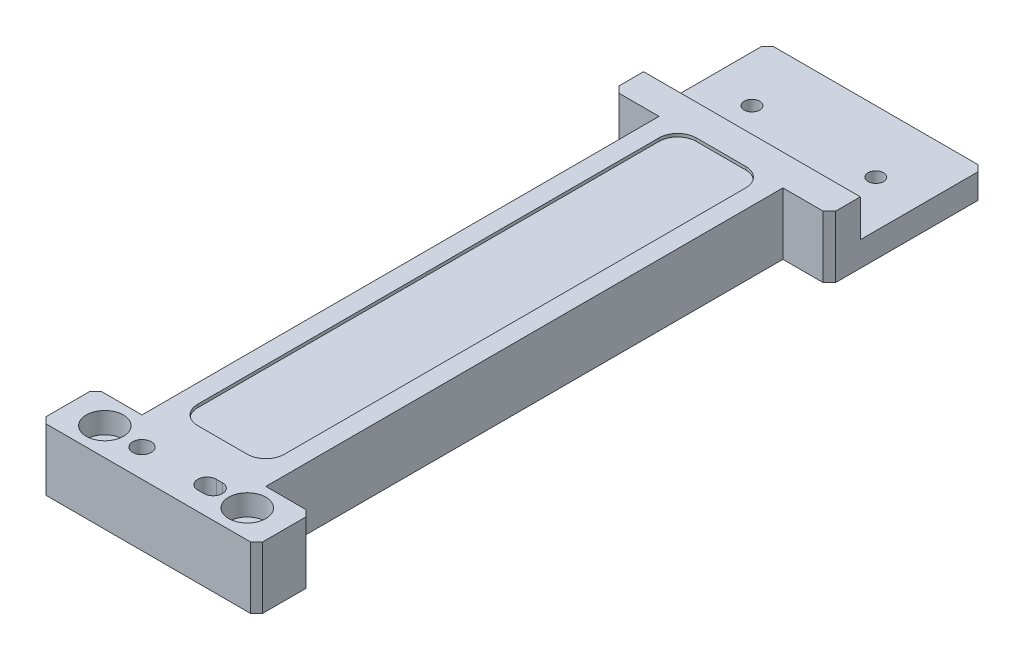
ISO-10303-21;
HEADER;
FILE_DESCRIPTION(('STEP AP214'),'2;1');
FILE_NAME('part.step','',(''),(''),'','','');
FILE_SCHEMA(('AUTOMOTIVE_DESIGN { 1 0 10303 214 1 1 1 1 }'));
ENDSEC;
DATA;
#1=APPLICATION_CONTEXT('core data for automotive mechanical design processes');
#2=APPLICATION_PROTOCOL_DEFINITION('international standard','automotive_design',2000,#1);
#3=PRODUCT_CONTEXT('',#1,'mechanical');
#4=PRODUCT('Part','Part','',(#3));
#5=PRODUCT_RELATED_PRODUCT_CATEGORY('part','',(#4));
#6=PRODUCT_DEFINITION_FORMATION('','',#4);
#7=PRODUCT_DEFINITION_CONTEXT('part definition',#1,'design');
#8=PRODUCT_DEFINITION('design','',#6,#7);
#9=PRODUCT_DEFINITION_SHAPE('','',#8);
#10=(LENGTH_UNIT() NAMED_UNIT(*) SI_UNIT(.MILLI.,.METRE.));
#11=(NAMED_UNIT(*) PLANE_ANGLE_UNIT() SI_UNIT($,.RADIAN.));
#12=(NAMED_UNIT(*) SI_UNIT($,.STERADIAN.) SOLID_ANGLE_UNIT());
#13=UNCERTAINTY_MEASURE_WITH_UNIT(LENGTH_MEASURE(1.E-05),#10,'distance_accuracy_value','');
#14=(GEOMETRIC_REPRESENTATION_CONTEXT(3) GLOBAL_UNCERTAINTY_ASSIGNED_CONTEXT((#13)) GLOBAL_UNIT_ASSIGNED_CONTEXT((#10,
#11,#12)) REPRESENTATION_CONTEXT('',''));
#15=CARTESIAN_POINT('',(0.,0.,0.));
#16=DIRECTION('',(0.,0.,1.));
#17=DIRECTION('',(1.,0.,0.));
#18=AXIS2_PLACEMENT_3D('',#15,#16,#17);
#19=CARTESIAN_POINT('',(11.5,10.,54.25));
#20=DIRECTION('',(0.,1.,0.));
#21=DIRECTION('',(0.,0.,1.));
#22=AXIS2_PLACEMENT_3D('',#19,#20,#21);
#23=CYLINDRICAL_SURFACE('',#22,1.7);
#24=CARTESIAN_POINT('',(11.5,6.6,54.25));
#25=DIRECTION('',(0.,1.,0.));
#26=DIRECTION('',(0.,0.,1.));
#27=AXIS2_PLACEMENT_3D('',#24,#25,#26);
#28=CIRCLE('',#27,1.7);
#29=CARTESIAN_POINT('',(11.5,6.6,55.95));
#30=VERTEX_POINT('',#29);
#31=EDGE_CURVE('E440',#30,#30,#28,.T.);
#32=ORIENTED_EDGE('',*,*,#31,.T.);
#33=EDGE_LOOP('',(#32));
#34=FACE_BOUND('',#33,.T.);
#35=CARTESIAN_POINT('',(11.5,3.4,54.25));
#36=DIRECTION('',(0.,-1.,0.));
#37=DIRECTION('',(0.,0.,-1.));
#38=AXIS2_PLACEMENT_3D('',#35,#36,#37);
#39=CIRCLE('',#38,1.7);
#40=CARTESIAN_POINT('',(11.5,3.4,52.55));
#41=VERTEX_POINT('',#40);
#42=EDGE_CURVE('E114',#41,#41,#39,.F.);
#43=ORIENTED_EDGE('',*,*,#42,.F.);
#44=EDGE_LOOP('',(#43));
#45=FACE_BOUND('',#44,.T.);
#46=ADVANCED_FACE('F110',(#34,#45),#23,.F.);
#47=CARTESIAN_POINT('',(-11.5,10.,54.25));
#48=DIRECTION('',(0.,1.,0.));
#49=DIRECTION('',(0.,0.,1.));
#50=AXIS2_PLACEMENT_3D('',#47,#48,#49);
#51=CYLINDRICAL_SURFACE('',#50,1.7);
#52=CARTESIAN_POINT('',(-11.5,6.6,54.25));
#53=DIRECTION('',(0.,1.,0.));
#54=DIRECTION('',(0.,0.,1.));
#55=AXIS2_PLACEMENT_3D('',#52,#53,#54);
#56=CIRCLE('',#55,1.7);
#57=CARTESIAN_POINT('',(-11.5,6.6,55.95));
#58=VERTEX_POINT('',#57);
#59=EDGE_CURVE('E431',#58,#58,#56,.T.);
#60=ORIENTED_EDGE('',*,*,#59,.T.);
#61=EDGE_LOOP('',(#60));
#62=FACE_BOUND('',#61,.T.);
#63=CARTESIAN_POINT('',(-11.5,3.4,54.25));
#64=DIRECTION('',(0.,-1.,0.));
#65=DIRECTION('',(0.,0.,-1.));
#66=AXIS2_PLACEMENT_3D('',#63,#64,#65);
#67=CIRCLE('',#66,1.7);
#68=CARTESIAN_POINT('',(-11.5,3.4,52.55));
#69=VERTEX_POINT('',#68);
#70=EDGE_CURVE('E668',#69,#69,#67,.F.);
#71=ORIENTED_EDGE('',*,*,#70,.F.);
#72=EDGE_LOOP('',(#71));
#73=FACE_BOUND('',#72,.T.);
#74=ADVANCED_FACE('F769',(#62,#73),#51,.F.);
#75=CARTESIAN_POINT('',(0.,10.,0.));
#76=DIRECTION('',(0.,1.,0.));
#77=DIRECTION('',(0.,0.,1.));
#78=AXIS2_PLACEMENT_3D('',#75,#76,#77);
#79=PLANE('',#78);
#80=CARTESIAN_POINT('',(-5.5,10.,54.25));
#81=DIRECTION('',(0.,1.,0.));
#82=DIRECTION('',(0.,0.,1.));
#83=AXIS2_PLACEMENT_3D('',#80,#81,#82);
#84=CIRCLE('',#83,1.5);
#85=CARTESIAN_POINT('',(-5.5,10.,55.75));
#86=VERTEX_POINT('',#85);
#87=EDGE_CURVE('E419',#86,#86,#84,.T.);
#88=ORIENTED_EDGE('',*,*,#87,.F.);
#89=EDGE_LOOP('',(#88));
#90=FACE_BOUND('',#89,.T.);
#91=CARTESIAN_POINT('',(-11.5,10.,54.25));
#92=DIRECTION('',(0.,1.,0.));
#93=DIRECTION('',(0.,0.,1.));
#94=AXIS2_PLACEMENT_3D('',#91,#92,#93);
#95=CIRCLE('',#94,3.);
#96=CARTESIAN_POINT('',(-11.5,10.,57.25));
#97=VERTEX_POINT('',#96);
#98=EDGE_CURVE('E425',#97,#97,#95,.T.);
#99=ORIENTED_EDGE('',*,*,#98,.F.);
#100=EDGE_LOOP('',(#99));
#101=FACE_BOUND('',#100,.T.);
#102=CARTESIAN_POINT('',(11.5,10.,54.25));
#103=DIRECTION('',(0.,1.,0.));
#104=DIRECTION('',(0.,0.,1.));
#105=AXIS2_PLACEMENT_3D('',#102,#103,#104);
#106=CIRCLE('',#105,3.);
#107=CARTESIAN_POINT('',(11.5,10.,57.25));
#108=VERTEX_POINT('',#107);
#109=EDGE_CURVE('E434',#108,#108,#106,.T.);
#110=ORIENTED_EDGE('',*,*,#109,.F.);
#111=EDGE_LOOP('',(#110));
#112=FACE_BOUND('',#111,.T.);
#113=DIRECTION('',(1.,0.,0.));
#114=VECTOR('',#113,1.);
#115=CARTESIAN_POINT('',(17.5,10.,-33.75));
#116=LINE('',#115,#114);
#117=CARTESIAN_POINT('',(10.,10.,-33.75));
#118=VERTEX_POINT('',#117);
#119=CARTESIAN_POINT('',(16.5,10.,-33.75));
#120=VERTEX_POINT('',#119);
#121=EDGE_CURVE('E467',#118,#120,#116,.T.);
#122=ORIENTED_EDGE('',*,*,#121,.T.);
#123=DIRECTION('',(-0.707106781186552,0.,0.707106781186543));
#124=VECTOR('',#123,1.);
#125=CARTESIAN_POINT('',(-8.62500000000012,10.,-8.62500000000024));
#126=LINE('',#125,#124);
#127=CARTESIAN_POINT('',(17.5,10.,-34.75));
#128=VERTEX_POINT('',#127);
#129=EDGE_CURVE('E562',#120,#128,#126,.F.);
#130=ORIENTED_EDGE('',*,*,#129,.T.);
#131=DIRECTION('',(0.,0.,-1.));
#132=VECTOR('',#131,1.);
#133=CARTESIAN_POINT('',(17.5,10.,58.75));
#134=LINE('',#133,#132);
#135=CARTESIAN_POINT('',(17.5,10.,-38.75));
#136=VERTEX_POINT('',#135);
#137=EDGE_CURVE('E512',#128,#136,#134,.T.);
#138=ORIENTED_EDGE('',*,*,#137,.T.);
#139=DIRECTION('',(1.,0.,0.));
#140=VECTOR('',#139,1.);
#141=CARTESIAN_POINT('',(17.5,10.,-38.75));
#142=LINE('',#141,#140);
#143=CARTESIAN_POINT('',(-17.5,10.,-38.75));
#144=VERTEX_POINT('',#143);
#145=EDGE_CURVE('E464',#144,#136,#142,.T.);
#146=ORIENTED_EDGE('',*,*,#145,.F.);
#147=DIRECTION('',(0.,0.,1.));
#148=VECTOR('',#147,1.);
#149=CARTESIAN_POINT('',(-17.5,10.,58.75));
#150=LINE('',#149,#148);
#151=CARTESIAN_POINT('',(-17.5,10.,-34.75));
#152=VERTEX_POINT('',#151);
#153=EDGE_CURVE('E505',#144,#152,#150,.T.);
#154=ORIENTED_EDGE('',*,*,#153,.T.);
#155=DIRECTION('',(-0.70710678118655,0.,-0.707106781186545));
#156=VECTOR('',#155,1.);
#157=CARTESIAN_POINT('',(8.62500000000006,10.,-8.62500000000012));
#158=LINE('',#157,#156);
#159=CARTESIAN_POINT('',(-16.5,10.,-33.75));
#160=VERTEX_POINT('',#159);
#161=EDGE_CURVE('E560',#152,#160,#158,.F.);
#162=ORIENTED_EDGE('',*,*,#161,.T.);
#163=DIRECTION('',(1.,0.,0.));
#164=VECTOR('',#163,1.);
#165=CARTESIAN_POINT('',(-17.5,10.,-33.75));
#166=LINE('',#165,#164);
#167=CARTESIAN_POINT('',(-10.,10.,-33.75));
#168=VERTEX_POINT('',#167);
#169=EDGE_CURVE('E444',#160,#168,#166,.T.);
#170=ORIENTED_EDGE('',*,*,#169,.T.);
#171=DIRECTION('',(0.,0.,1.));
#172=VECTOR('',#171,1.);
#173=CARTESIAN_POINT('',(-10.,10.,-33.75));
#174=LINE('',#173,#172);
#175=CARTESIAN_POINT('',(-10.,10.,49.75));
#176=VERTEX_POINT('',#175);
#177=EDGE_CURVE('E446',#168,#176,#174,.T.);
#178=ORIENTED_EDGE('',*,*,#177,.T.);
#179=DIRECTION('',(-1.,0.,0.));
#180=VECTOR('',#179,1.);
#181=CARTESIAN_POINT('',(-17.5,10.,49.75));
#182=LINE('',#181,#180);
#183=CARTESIAN_POINT('',(-16.5,10.,49.75));
#184=VERTEX_POINT('',#183);
#185=EDGE_CURVE('E450',#176,#184,#182,.T.);
#186=ORIENTED_EDGE('',*,*,#185,.T.);
#187=DIRECTION('',(0.707106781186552,0.,-0.707106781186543));
#188=VECTOR('',#187,1.);
#189=CARTESIAN_POINT('',(16.6250000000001,10.,16.6250000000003));
#190=LINE('',#189,#188);
#191=CARTESIAN_POINT('',(-17.5,10.,50.75));
#192=VERTEX_POINT('',#191);
#193=EDGE_CURVE('E554',#184,#192,#190,.F.);
#194=ORIENTED_EDGE('',*,*,#193,.T.);
#195=CARTESIAN_POINT('',(-17.5,10.,57.75));
#196=VERTEX_POINT('',#195);
#197=EDGE_CURVE('E509',#192,#196,#150,.T.);
#198=ORIENTED_EDGE('',*,*,#197,.T.);
#199=DIRECTION('',(-0.707106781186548,0.,-0.707106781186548));
#200=VECTOR('',#199,1.);
#201=CARTESIAN_POINT('',(-37.625,10.,37.625));
#202=LINE('',#201,#200);
#203=CARTESIAN_POINT('',(-16.5,10.,58.75));
#204=VERTEX_POINT('',#203);
#205=EDGE_CURVE('E552',#196,#204,#202,.F.);
#206=ORIENTED_EDGE('',*,*,#205,.T.);
#207=DIRECTION('',(1.,0.,0.));
#208=VECTOR('',#207,1.);
#209=CARTESIAN_POINT('',(17.5,10.,58.75));
#210=LINE('',#209,#208);
#211=CARTESIAN_POINT('',(16.5,10.,58.75));
#212=VERTEX_POINT('',#211);
#213=EDGE_CURVE('E508',#204,#212,#210,.T.);
#214=ORIENTED_EDGE('',*,*,#213,.T.);
#215=DIRECTION('',(-0.707106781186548,0.,0.707106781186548));
#216=VECTOR('',#215,1.);
#217=CARTESIAN_POINT('',(37.625,10.,37.625));
#218=LINE('',#217,#216);
#219=CARTESIAN_POINT('',(17.5,10.,57.75));
#220=VERTEX_POINT('',#219);
#221=EDGE_CURVE('E558',#212,#220,#218,.F.);
#222=ORIENTED_EDGE('',*,*,#221,.T.);
#223=CARTESIAN_POINT('',(17.5,10.,50.75));
#224=VERTEX_POINT('',#223);
#225=EDGE_CURVE('E513',#220,#224,#134,.T.);
#226=ORIENTED_EDGE('',*,*,#225,.T.);
#227=DIRECTION('',(0.707106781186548,0.,0.707106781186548));
#228=VECTOR('',#227,1.);
#229=CARTESIAN_POINT('',(-16.625,10.,16.625));
#230=LINE('',#229,#228);
#231=CARTESIAN_POINT('',(16.5,10.,49.75));
#232=VERTEX_POINT('',#231);
#233=EDGE_CURVE('E556',#224,#232,#230,.F.);
#234=ORIENTED_EDGE('',*,*,#233,.T.);
#235=DIRECTION('',(-1.,0.,0.));
#236=VECTOR('',#235,1.);
#237=CARTESIAN_POINT('',(17.5,10.,49.75));
#238=LINE('',#237,#236);
#239=CARTESIAN_POINT('',(10.,10.,49.75));
#240=VERTEX_POINT('',#239);
#241=EDGE_CURVE('E470',#232,#240,#238,.T.);
#242=ORIENTED_EDGE('',*,*,#241,.T.);
#243=DIRECTION('',(0.,0.,-1.));
#244=VECTOR('',#243,1.);
#245=CARTESIAN_POINT('',(10.,10.,-33.75));
#246=LINE('',#245,#244);
#247=EDGE_CURVE('E473',#240,#118,#246,.T.);
#248=ORIENTED_EDGE('',*,*,#247,.T.);
#249=EDGE_LOOP('',(#122,#130,#138,#146,#154,#162,#170,#178,#186,#194,#198,#206,#214,#222,#226,
#234,#242,#248));
#250=FACE_BOUND('',#249,.T.);
#251=CARTESIAN_POINT('',(5.,10.,54.25));
#252=DIRECTION('',(0.,1.,0.));
#253=DIRECTION('',(0.,0.,1.));
#254=AXIS2_PLACEMENT_3D('',#251,#252,#253);
#255=CIRCLE('',#254,1.49999999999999);
#256=CARTESIAN_POINT('',(5.,10.,52.75));
#257=VERTEX_POINT('',#256);
#258=CARTESIAN_POINT('',(5.,10.,55.75));
#259=VERTEX_POINT('',#258);
#260=EDGE_CURVE('E391',#257,#259,#255,.T.);
#261=ORIENTED_EDGE('',*,*,#260,.F.);
#262=DIRECTION('',(1.,0.,0.));
#263=VECTOR('',#262,1.);
#264=CARTESIAN_POINT('',(5.,10.,52.75));
#265=LINE('',#264,#263);
#266=CARTESIAN_POINT('',(6.,10.,52.75));
#267=VERTEX_POINT('',#266);
#268=EDGE_CURVE('E380',#257,#267,#265,.T.);
#269=ORIENTED_EDGE('',*,*,#268,.T.);
#270=CARTESIAN_POINT('',(6.,10.,54.25));
#271=DIRECTION('',(0.,1.,0.));
#272=DIRECTION('',(0.,0.,1.));
#273=AXIS2_PLACEMENT_3D('',#270,#271,#272);
#274=CIRCLE('',#273,1.49999999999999);
#275=CARTESIAN_POINT('',(6.,10.,55.7500000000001));
#276=VERTEX_POINT('',#275);
#277=EDGE_CURVE('E400',#276,#267,#274,.T.);
#278=ORIENTED_EDGE('',*,*,#277,.F.);
#279=DIRECTION('',(1.,0.,0.));
#280=VECTOR('',#279,1.);
#281=CARTESIAN_POINT('',(5.,10.,55.7500000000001));
#282=LINE('',#281,#280);
#283=EDGE_CURVE('E405',#259,#276,#282,.T.);
#284=ORIENTED_EDGE('',*,*,#283,.F.);
#285=EDGE_LOOP('',(#261,#269,#278,#284));
#286=FACE_BOUND('',#285,.T.);
#287=DIRECTION('',(0.,0.,-1.));
#288=VECTOR('',#287,1.);
#289=CARTESIAN_POINT('',(-7.,10.,46.75));
#290=LINE('',#289,#288);
#291=CARTESIAN_POINT('',(-7.,10.,43.75));
#292=VERTEX_POINT('',#291);
#293=CARTESIAN_POINT('',(-7.,10.,-30.75));
#294=VERTEX_POINT('',#293);
#295=EDGE_CURVE('E707',#292,#294,#290,.T.);
#296=ORIENTED_EDGE('',*,*,#295,.T.);
#297=CARTESIAN_POINT('',(-4.,10.,-30.75));
#298=DIRECTION('',(0.,1.,0.));
#299=DIRECTION('',(0.,0.,1.));
#300=AXIS2_PLACEMENT_3D('',#297,#298,#299);
#301=CIRCLE('',#300,3.);
#302=CARTESIAN_POINT('',(-4.,10.,-33.75));
#303=VERTEX_POINT('',#302);
#304=EDGE_CURVE('E119',#294,#303,#301,.F.);
#305=ORIENTED_EDGE('',*,*,#304,.T.);
#306=DIRECTION('',(1.,0.,0.));
#307=VECTOR('',#306,1.);
#308=CARTESIAN_POINT('',(-7.,10.,-33.75));
#309=LINE('',#308,#307);
#310=CARTESIAN_POINT('',(4.,10.,-33.75));
#311=VERTEX_POINT('',#310);
#312=EDGE_CURVE('E705',#303,#311,#309,.T.);
#313=ORIENTED_EDGE('',*,*,#312,.T.);
#314=CARTESIAN_POINT('',(4.,10.,-30.75));
#315=DIRECTION('',(0.,1.,0.));
#316=DIRECTION('',(0.,0.,1.));
#317=AXIS2_PLACEMENT_3D('',#314,#315,#316);
#318=CIRCLE('',#317,3.);
#319=CARTESIAN_POINT('',(7.,10.,-30.75));
#320=VERTEX_POINT('',#319);
#321=EDGE_CURVE('E13',#311,#320,#318,.F.);
#322=ORIENTED_EDGE('',*,*,#321,.T.);
#323=DIRECTION('',(0.,0.,1.));
#324=VECTOR('',#323,1.);
#325=CARTESIAN_POINT('',(7.,10.,46.75));
#326=LINE('',#325,#324);
#327=CARTESIAN_POINT('',(7.,10.,43.75));
#328=VERTEX_POINT('',#327);
#329=EDGE_CURVE('E674',#320,#328,#326,.T.);
#330=ORIENTED_EDGE('',*,*,#329,.T.);
#331=CARTESIAN_POINT('',(4.,10.,43.75));
#332=DIRECTION('',(0.,1.,0.));
#333=DIRECTION('',(0.,0.,1.));
#334=AXIS2_PLACEMENT_3D('',#331,#332,#333);
#335=CIRCLE('',#334,3.);
#336=CARTESIAN_POINT('',(4.,10.,46.75));
#337=VERTEX_POINT('',#336);
#338=EDGE_CURVE('E666',#328,#337,#335,.F.);
#339=ORIENTED_EDGE('',*,*,#338,.T.);
#340=DIRECTION('',(-1.,0.,0.));
#341=VECTOR('',#340,1.);
#342=CARTESIAN_POINT('',(-7.,10.,46.75));
#343=LINE('',#342,#341);
#344=CARTESIAN_POINT('',(-4.,10.,46.75));
#345=VERTEX_POINT('',#344);
#346=EDGE_CURVE('E693',#337,#345,#343,.T.);
#347=ORIENTED_EDGE('',*,*,#346,.T.);
#348=CARTESIAN_POINT('',(-4.,10.,43.75));
#349=DIRECTION('',(0.,1.,0.));
#350=DIRECTION('',(0.,0.,1.));
#351=AXIS2_PLACEMENT_3D('',#348,#349,#350);
#352=CIRCLE('',#351,3.);
#353=EDGE_CURVE('E664',#345,#292,#352,.F.);
#354=ORIENTED_EDGE('',*,*,#353,.T.);
#355=EDGE_LOOP('',(#296,#305,#313,#322,#330,#339,#347,#354));
#356=FACE_BOUND('',#355,.T.);
#357=ADVANCED_FACE('F404',(#90,#101,#112,#250,#286,#356),#79,.T.);
#358=CARTESIAN_POINT('',(-17.5,10.,58.75));
#359=DIRECTION('',(1.,0.,0.));
#360=DIRECTION('',(0.,0.,-1.));
#361=AXIS2_PLACEMENT_3D('',#358,#359,#360);
#362=PLANE('',#361);
#363=ORIENTED_EDGE('',*,*,#197,.F.);
#364=DIRECTION('',(0.,-1.,0.));
#365=VECTOR('',#364,1.);
#366=CARTESIAN_POINT('',(-17.5,10.,50.75));
#367=LINE('',#366,#365);
#368=CARTESIAN_POINT('',(-17.5,0.,50.75));
#369=VERTEX_POINT('',#368);
#370=EDGE_CURVE('E596',#192,#369,#367,.T.);
#371=ORIENTED_EDGE('',*,*,#370,.T.);
#372=DIRECTION('',(0.,0.,1.));
#373=VECTOR('',#372,1.);
#374=CARTESIAN_POINT('',(-17.5,0.,58.75));
#375=LINE('',#374,#373);
#376=CARTESIAN_POINT('',(-17.5,0.,57.75));
#377=VERTEX_POINT('',#376);
#378=EDGE_CURVE('E503',#369,#377,#375,.T.);
#379=ORIENTED_EDGE('',*,*,#378,.T.);
#380=DIRECTION('',(0.,1.,0.));
#381=VECTOR('',#380,1.);
#382=CARTESIAN_POINT('',(-17.5,10.,57.75));
#383=LINE('',#382,#381);
#384=EDGE_CURVE('E594',#377,#196,#383,.T.);
#385=ORIENTED_EDGE('',*,*,#384,.T.);
#386=EDGE_LOOP('',(#363,#371,#379,#385));
#387=FACE_BOUND('',#386,.T.);
#388=ADVANCED_FACE('F817',(#387),#362,.F.);
#389=CARTESIAN_POINT('',(17.5,10.,58.75));
#390=DIRECTION('',(-1.,0.,0.));
#391=DIRECTION('',(0.,0.,1.));
#392=AXIS2_PLACEMENT_3D('',#389,#390,#391);
#393=PLANE('',#392);
#394=ORIENTED_EDGE('',*,*,#137,.F.);
#395=DIRECTION('',(0.,-1.,0.));
#396=VECTOR('',#395,1.);
#397=CARTESIAN_POINT('',(17.5,10.,-34.75));
#398=LINE('',#397,#396);
#399=CARTESIAN_POINT('',(17.5,0.,-34.75));
#400=VERTEX_POINT('',#399);
#401=EDGE_CURVE('E531',#128,#400,#398,.T.);
#402=ORIENTED_EDGE('',*,*,#401,.T.);
#403=DIRECTION('',(0.,0.,-1.));
#404=VECTOR('',#403,1.);
#405=CARTESIAN_POINT('',(17.5,0.,58.75));
#406=LINE('',#405,#404);
#407=CARTESIAN_POINT('',(17.5,0.,-57.75));
#408=VERTEX_POINT('',#407);
#409=EDGE_CURVE('E523',#400,#408,#406,.T.);
#410=ORIENTED_EDGE('',*,*,#409,.T.);
#411=DIRECTION('',(0.,1.,0.));
#412=VECTOR('',#411,1.);
#413=CARTESIAN_POINT('',(17.5,10.,-57.75));
#414=LINE('',#413,#412);
#415=CARTESIAN_POINT('',(17.5,4.,-57.75));
#416=VERTEX_POINT('',#415);
#417=EDGE_CURVE('E516',#408,#416,#414,.T.);
#418=ORIENTED_EDGE('',*,*,#417,.T.);
#419=DIRECTION('',(0.,0.,-1.));
#420=VECTOR('',#419,1.);
#421=CARTESIAN_POINT('',(17.5,4.,-38.75));
#422=LINE('',#421,#420);
#423=CARTESIAN_POINT('',(17.5,4.,-38.75));
#424=VERTEX_POINT('',#423);
#425=EDGE_CURVE('E486',#424,#416,#422,.T.);
#426=ORIENTED_EDGE('',*,*,#425,.F.);
#427=DIRECTION('',(0.,1.,0.));
#428=VECTOR('',#427,1.);
#429=CARTESIAN_POINT('',(17.5,4.,-38.75));
#430=LINE('',#429,#428);
#431=EDGE_CURVE('E500',#424,#136,#430,.T.);
#432=ORIENTED_EDGE('',*,*,#431,.T.);
#433=EDGE_LOOP('',(#394,#402,#410,#418,#426,#432));
#434=FACE_BOUND('',#433,.T.);
#435=ADVANCED_FACE('F827',(#434),#393,.F.);
#436=CARTESIAN_POINT('',(17.5,10.,-58.75));
#437=DIRECTION('',(0.,0.,1.));
#438=DIRECTION('',(1.,0.,0.));
#439=AXIS2_PLACEMENT_3D('',#436,#437,#438);
#440=PLANE('',#439);
#441=DIRECTION('',(-1.,0.,0.));
#442=VECTOR('',#441,1.);
#443=CARTESIAN_POINT('',(17.5,4.,-58.75));
#444=LINE('',#443,#442);
#445=CARTESIAN_POINT('',(16.5,4.,-58.75));
#446=VERTEX_POINT('',#445);
#447=CARTESIAN_POINT('',(-16.5,4.,-58.75));
#448=VERTEX_POINT('',#447);
#449=EDGE_CURVE('E489',#446,#448,#444,.T.);
#450=ORIENTED_EDGE('',*,*,#449,.F.);
#451=DIRECTION('',(0.,-1.,0.));
#452=VECTOR('',#451,1.);
#453=CARTESIAN_POINT('',(16.5,10.,-58.75));
#454=LINE('',#453,#452);
#455=CARTESIAN_POINT('',(16.5,0.,-58.75));
#456=VERTEX_POINT('',#455);
#457=EDGE_CURVE('E566',#446,#456,#454,.T.);
#458=ORIENTED_EDGE('',*,*,#457,.T.);
#459=DIRECTION('',(-1.,0.,0.));
#460=VECTOR('',#459,1.);
#461=CARTESIAN_POINT('',(17.5,0.,-58.75));
#462=LINE('',#461,#460);
#463=CARTESIAN_POINT('',(-16.5,0.,-58.75));
#464=VERTEX_POINT('',#463);
#465=EDGE_CURVE('E527',#456,#464,#462,.T.);
#466=ORIENTED_EDGE('',*,*,#465,.T.);
#467=DIRECTION('',(0.,1.,0.));
#468=VECTOR('',#467,1.);
#469=CARTESIAN_POINT('',(-16.5,10.,-58.75));
#470=LINE('',#469,#468);
#471=EDGE_CURVE('E564',#464,#448,#470,.T.);
#472=ORIENTED_EDGE('',*,*,#471,.T.);
#473=EDGE_LOOP('',(#450,#458,#466,#472));
#474=FACE_BOUND('',#473,.T.);
#475=ADVANCED_FACE('F823',(#474),#440,.F.);
#476=DIRECTION('',(0.,0.,1.));
#477=VECTOR('',#476,1.);
#478=CARTESIAN_POINT('',(-17.5,4.,-38.75));
#479=LINE('',#478,#477);
#480=CARTESIAN_POINT('',(-17.5,4.,-57.75));
#481=VERTEX_POINT('',#480);
#482=CARTESIAN_POINT('',(-17.5,4.,-38.75));
#483=VERTEX_POINT('',#482);
#484=EDGE_CURVE('E492',#481,#483,#479,.T.);
#485=ORIENTED_EDGE('',*,*,#484,.F.);
#486=DIRECTION('',(0.,-1.,0.));
#487=VECTOR('',#486,1.);
#488=CARTESIAN_POINT('',(-17.5,10.,-57.75));
#489=LINE('',#488,#487);
#490=CARTESIAN_POINT('',(-17.5,0.,-57.75));
#491=VERTEX_POINT('',#490);
#492=EDGE_CURVE('E575',#481,#491,#489,.T.);
#493=ORIENTED_EDGE('',*,*,#492,.T.);
#494=CARTESIAN_POINT('',(-17.5,0.,-34.75));
#495=VERTEX_POINT('',#494);
#496=EDGE_CURVE('E517',#491,#495,#375,.T.);
#497=ORIENTED_EDGE('',*,*,#496,.T.);
#498=DIRECTION('',(0.,1.,0.));
#499=VECTOR('',#498,1.);
#500=CARTESIAN_POINT('',(-17.5,10.,-34.75));
#501=LINE('',#500,#499);
#502=EDGE_CURVE('E573',#495,#152,#501,.T.);
#503=ORIENTED_EDGE('',*,*,#502,.T.);
#504=ORIENTED_EDGE('',*,*,#153,.F.);
#505=DIRECTION('',(0.,1.,0.));
#506=VECTOR('',#505,1.);
#507=CARTESIAN_POINT('',(-17.5,4.,-38.75));
#508=LINE('',#507,#506);
#509=EDGE_CURVE('E497',#483,#144,#508,.T.);
#510=ORIENTED_EDGE('',*,*,#509,.F.);
#511=EDGE_LOOP('',(#485,#493,#497,#503,#504,#510));
#512=FACE_BOUND('',#511,.T.);
#513=ADVANCED_FACE('F826',(#512),#362,.F.);
#514=CARTESIAN_POINT('',(17.5,10.,58.75));
#515=DIRECTION('',(0.,0.,-1.));
#516=DIRECTION('',(-1.,0.,0.));
#517=AXIS2_PLACEMENT_3D('',#514,#515,#516);
#518=PLANE('',#517);
#519=DIRECTION('',(1.,0.,0.));
#520=VECTOR('',#519,1.);
#521=CARTESIAN_POINT('',(17.5,0.,58.75));
#522=LINE('',#521,#520);
#523=CARTESIAN_POINT('',(-16.5,0.,58.75));
#524=VERTEX_POINT('',#523);
#525=CARTESIAN_POINT('',(16.5,0.,58.75));
#526=VERTEX_POINT('',#525);
#527=EDGE_CURVE('E520',#524,#526,#522,.T.);
#528=ORIENTED_EDGE('',*,*,#527,.T.);
#529=DIRECTION('',(0.,1.,0.));
#530=VECTOR('',#529,1.);
#531=CARTESIAN_POINT('',(16.5,10.,58.75));
#532=LINE('',#531,#530);
#533=EDGE_CURVE('E589',#526,#212,#532,.T.);
#534=ORIENTED_EDGE('',*,*,#533,.T.);
#535=ORIENTED_EDGE('',*,*,#213,.F.);
#536=DIRECTION('',(0.,-1.,0.));
#537=VECTOR('',#536,1.);
#538=CARTESIAN_POINT('',(-16.5,10.,58.75));
#539=LINE('',#538,#537);
#540=EDGE_CURVE('E586',#204,#524,#539,.T.);
#541=ORIENTED_EDGE('',*,*,#540,.T.);
#542=EDGE_LOOP('',(#528,#534,#535,#541));
#543=FACE_BOUND('',#542,.T.);
#544=ADVANCED_FACE('F831',(#543),#518,.F.);
#545=ORIENTED_EDGE('',*,*,#225,.F.);
#546=DIRECTION('',(0.,-1.,0.));
#547=VECTOR('',#546,1.);
#548=CARTESIAN_POINT('',(17.5,10.,57.75));
#549=LINE('',#548,#547);
#550=CARTESIAN_POINT('',(17.5,0.,57.75));
#551=VERTEX_POINT('',#550);
#552=EDGE_CURVE('E583',#220,#551,#549,.T.);
#553=ORIENTED_EDGE('',*,*,#552,.T.);
#554=CARTESIAN_POINT('',(17.5,0.,50.75));
#555=VERTEX_POINT('',#554);
#556=EDGE_CURVE('E524',#551,#555,#406,.T.);
#557=ORIENTED_EDGE('',*,*,#556,.T.);
#558=DIRECTION('',(0.,1.,0.));
#559=VECTOR('',#558,1.);
#560=CARTESIAN_POINT('',(17.5,10.,50.75));
#561=LINE('',#560,#559);
#562=EDGE_CURVE('E581',#555,#224,#561,.T.);
#563=ORIENTED_EDGE('',*,*,#562,.T.);
#564=EDGE_LOOP('',(#545,#553,#557,#563));
#565=FACE_BOUND('',#564,.T.);
#566=ADVANCED_FACE('F821',(#565),#393,.F.);
#567=CARTESIAN_POINT('',(0.,0.,0.));
#568=DIRECTION('',(0.,1.,0.));
#569=DIRECTION('',(0.,0.,1.));
#570=AXIS2_PLACEMENT_3D('',#567,#568,#569);
#571=PLANE('',#570);
#572=CARTESIAN_POINT('',(-11.5,0.,54.25));
#573=DIRECTION('',(0.,-1.,0.));
#574=DIRECTION('',(0.,0.,-1.));
#575=AXIS2_PLACEMENT_3D('',#572,#573,#574);
#576=CIRCLE('',#575,3.);
#577=CARTESIAN_POINT('',(-11.5,0.,51.25));
#578=VERTEX_POINT('',#577);
#579=EDGE_CURVE('E676',#578,#578,#576,.T.);
#580=ORIENTED_EDGE('',*,*,#579,.F.);
#581=EDGE_LOOP('',(#580));
#582=FACE_BOUND('',#581,.T.);
#583=CARTESIAN_POINT('',(11.5,0.,54.25));
#584=DIRECTION('',(0.,-1.,0.));
#585=DIRECTION('',(0.,0.,-1.));
#586=AXIS2_PLACEMENT_3D('',#583,#584,#585);
#587=CIRCLE('',#586,3.);
#588=CARTESIAN_POINT('',(11.5,0.,51.25));
#589=VERTEX_POINT('',#588);
#590=EDGE_CURVE('E686',#589,#589,#587,.T.);
#591=ORIENTED_EDGE('',*,*,#590,.F.);
#592=EDGE_LOOP('',(#591));
#593=FACE_BOUND('',#592,.T.);
#594=DIRECTION('',(-1.,0.,0.));
#595=VECTOR('',#594,1.);
#596=CARTESIAN_POINT('',(-7.,0.,46.75));
#597=LINE('',#596,#595);
#598=CARTESIAN_POINT('',(4.,0.,46.75));
#599=VERTEX_POINT('',#598);
#600=CARTESIAN_POINT('',(-4.,0.,46.75));
#601=VERTEX_POINT('',#600);
#602=EDGE_CURVE('E727',#599,#601,#597,.T.);
#603=ORIENTED_EDGE('',*,*,#602,.F.);
#604=CARTESIAN_POINT('',(4.,0.,43.75));
#605=DIRECTION('',(0.,1.,0.));
#606=DIRECTION('',(0.,0.,1.));
#607=AXIS2_PLACEMENT_3D('',#604,#605,#606);
#608=CIRCLE('',#607,3.);
#609=CARTESIAN_POINT('',(7.,0.,43.75));
#610=VERTEX_POINT('',#609);
#611=EDGE_CURVE('E631',#599,#610,#608,.T.);
#612=ORIENTED_EDGE('',*,*,#611,.T.);
#613=DIRECTION('',(0.,0.,1.));
#614=VECTOR('',#613,1.);
#615=CARTESIAN_POINT('',(7.,0.,46.75));
#616=LINE('',#615,#614);
#617=CARTESIAN_POINT('',(7.,0.,-30.75));
#618=VERTEX_POINT('',#617);
#619=EDGE_CURVE('E702',#618,#610,#616,.T.);
#620=ORIENTED_EDGE('',*,*,#619,.F.);
#621=CARTESIAN_POINT('',(4.,0.,-30.75));
#622=DIRECTION('',(0.,1.,0.));
#623=DIRECTION('',(0.,0.,1.));
#624=AXIS2_PLACEMENT_3D('',#621,#622,#623);
#625=CIRCLE('',#624,3.);
#626=CARTESIAN_POINT('',(4.,0.,-33.75));
#627=VERTEX_POINT('',#626);
#628=EDGE_CURVE('E635',#618,#627,#625,.T.);
#629=ORIENTED_EDGE('',*,*,#628,.T.);
#630=DIRECTION('',(1.,0.,0.));
#631=VECTOR('',#630,1.);
#632=CARTESIAN_POINT('',(-7.,0.,-33.75));
#633=LINE('',#632,#631);
#634=CARTESIAN_POINT('',(-4.,0.,-33.75));
#635=VERTEX_POINT('',#634);
#636=EDGE_CURVE('E715',#635,#627,#633,.T.);
#637=ORIENTED_EDGE('',*,*,#636,.F.);
#638=CARTESIAN_POINT('',(-4.,0.,-30.75));
#639=DIRECTION('',(0.,1.,0.));
#640=DIRECTION('',(0.,0.,1.));
#641=AXIS2_PLACEMENT_3D('',#638,#639,#640);
#642=CIRCLE('',#641,3.);
#643=CARTESIAN_POINT('',(-7.,0.,-30.75));
#644=VERTEX_POINT('',#643);
#645=EDGE_CURVE('E633',#635,#644,#642,.T.);
#646=ORIENTED_EDGE('',*,*,#645,.T.);
#647=DIRECTION('',(0.,0.,-1.));
#648=VECTOR('',#647,1.);
#649=CARTESIAN_POINT('',(-7.,0.,46.75));
#650=LINE('',#649,#648);
#651=CARTESIAN_POINT('',(-7.,0.,43.75));
#652=VERTEX_POINT('',#651);
#653=EDGE_CURVE('E730',#652,#644,#650,.T.);
#654=ORIENTED_EDGE('',*,*,#653,.F.);
#655=CARTESIAN_POINT('',(-4.,0.,43.75));
#656=DIRECTION('',(0.,1.,0.));
#657=DIRECTION('',(0.,0.,1.));
#658=AXIS2_PLACEMENT_3D('',#655,#656,#657);
#659=CIRCLE('',#658,3.);
#660=EDGE_CURVE('E629',#652,#601,#659,.T.);
#661=ORIENTED_EDGE('',*,*,#660,.T.);
#662=EDGE_LOOP('',(#603,#612,#620,#629,#637,#646,#654,#661));
#663=FACE_BOUND('',#662,.T.);
#664=CARTESIAN_POINT('',(-10.,0.,-48.75));
#665=DIRECTION('',(0.,1.,0.));
#666=DIRECTION('',(0.,0.,1.));
#667=AXIS2_PLACEMENT_3D('',#664,#665,#666);
#668=CIRCLE('',#667,1.25);
#669=CARTESIAN_POINT('',(-10.,0.,-47.5));
#670=VERTEX_POINT('',#669);
#671=EDGE_CURVE('E737',#670,#670,#668,.T.);
#672=ORIENTED_EDGE('',*,*,#671,.T.);
#673=EDGE_LOOP('',(#672));
#674=FACE_BOUND('',#673,.T.);
#675=CARTESIAN_POINT('',(10.,0.,-48.75));
#676=DIRECTION('',(0.,1.,0.));
#677=DIRECTION('',(0.,0.,1.));
#678=AXIS2_PLACEMENT_3D('',#675,#676,#677);
#679=CIRCLE('',#678,1.25);
#680=CARTESIAN_POINT('',(10.,0.,-47.5));
#681=VERTEX_POINT('',#680);
#682=EDGE_CURVE('E743',#681,#681,#679,.T.);
#683=ORIENTED_EDGE('',*,*,#682,.T.);
#684=EDGE_LOOP('',(#683));
#685=FACE_BOUND('',#684,.T.);
#686=DIRECTION('',(1.,0.,0.));
#687=VECTOR('',#686,1.);
#688=CARTESIAN_POINT('',(5.,0.,55.75));
#689=LINE('',#688,#687);
#690=CARTESIAN_POINT('',(5.,0.,55.75));
#691=VERTEX_POINT('',#690);
#692=CARTESIAN_POINT('',(6.,0.,55.75));
#693=VERTEX_POINT('',#692);
#694=EDGE_CURVE('E747',#691,#693,#689,.T.);
#695=ORIENTED_EDGE('',*,*,#694,.T.);
#696=CARTESIAN_POINT('',(6.,0.,54.25));
#697=DIRECTION('',(0.,1.,0.));
#698=DIRECTION('',(0.,0.,1.));
#699=AXIS2_PLACEMENT_3D('',#696,#697,#698);
#700=CIRCLE('',#699,1.5);
#701=CARTESIAN_POINT('',(6.,0.,52.75));
#702=VERTEX_POINT('',#701);
#703=EDGE_CURVE('E412',#693,#702,#700,.T.);
#704=ORIENTED_EDGE('',*,*,#703,.T.);
#705=DIRECTION('',(1.,0.,0.));
#706=VECTOR('',#705,1.);
#707=CARTESIAN_POINT('',(5.,0.,52.75));
#708=LINE('',#707,#706);
#709=CARTESIAN_POINT('',(5.,0.,52.75));
#710=VERTEX_POINT('',#709);
#711=EDGE_CURVE('E392',#710,#702,#708,.T.);
#712=ORIENTED_EDGE('',*,*,#711,.F.);
#713=CARTESIAN_POINT('',(5.,0.,54.25));
#714=DIRECTION('',(0.,1.,0.));
#715=DIRECTION('',(0.,0.,1.));
#716=AXIS2_PLACEMENT_3D('',#713,#714,#715);
#717=CIRCLE('',#716,1.5);
#718=EDGE_CURVE('E399',#710,#691,#717,.T.);
#719=ORIENTED_EDGE('',*,*,#718,.T.);
#720=EDGE_LOOP('',(#695,#704,#712,#719));
#721=FACE_BOUND('',#720,.T.);
#722=CARTESIAN_POINT('',(-5.5,0.,54.25));
#723=DIRECTION('',(0.,1.,0.));
#724=DIRECTION('',(0.,0.,1.));
#725=AXIS2_PLACEMENT_3D('',#722,#723,#724);
#726=CIRCLE('',#725,1.5);
#727=CARTESIAN_POINT('',(-5.5,0.,55.75));
#728=VERTEX_POINT('',#727);
#729=EDGE_CURVE('E422',#728,#728,#726,.T.);
#730=ORIENTED_EDGE('',*,*,#729,.T.);
#731=EDGE_LOOP('',(#730));
#732=FACE_BOUND('',#731,.T.);
#733=ORIENTED_EDGE('',*,*,#409,.F.);
#734=DIRECTION('',(0.707106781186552,0.,-0.707106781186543));
#735=VECTOR('',#734,1.);
#736=CARTESIAN_POINT('',(17.5,0.,-34.75));
#737=LINE('',#736,#735);
#738=CARTESIAN_POINT('',(16.5,0.,-33.75));
#739=VERTEX_POINT('',#738);
#740=EDGE_CURVE('E548',#400,#739,#737,.F.);
#741=ORIENTED_EDGE('',*,*,#740,.T.);
#742=DIRECTION('',(1.,0.,0.));
#743=VECTOR('',#742,1.);
#744=CARTESIAN_POINT('',(17.5,0.,-33.75));
#745=LINE('',#744,#743);
#746=CARTESIAN_POINT('',(10.,0.,-33.75));
#747=VERTEX_POINT('',#746);
#748=EDGE_CURVE('E443',#747,#739,#745,.T.);
#749=ORIENTED_EDGE('',*,*,#748,.F.);
#750=DIRECTION('',(0.,0.,-1.));
#751=VECTOR('',#750,1.);
#752=CARTESIAN_POINT('',(10.,0.,-33.75));
#753=LINE('',#752,#751);
#754=CARTESIAN_POINT('',(10.,0.,49.75));
#755=VERTEX_POINT('',#754);
#756=EDGE_CURVE('E471',#755,#747,#753,.T.);
#757=ORIENTED_EDGE('',*,*,#756,.F.);
#758=DIRECTION('',(-1.,0.,0.));
#759=VECTOR('',#758,1.);
#760=CARTESIAN_POINT('',(17.5,0.,49.75));
#761=LINE('',#760,#759);
#762=CARTESIAN_POINT('',(16.5,0.,49.75));
#763=VERTEX_POINT('',#762);
#764=EDGE_CURVE('E479',#763,#755,#761,.T.);
#765=ORIENTED_EDGE('',*,*,#764,.F.);
#766=DIRECTION('',(-0.707106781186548,0.,-0.707106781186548));
#767=VECTOR('',#766,1.);
#768=CARTESIAN_POINT('',(16.5,0.,49.75));
#769=LINE('',#768,#767);
#770=EDGE_CURVE('E538',#763,#555,#769,.F.);
#771=ORIENTED_EDGE('',*,*,#770,.T.);
#772=ORIENTED_EDGE('',*,*,#556,.F.);
#773=DIRECTION('',(0.707106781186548,0.,-0.707106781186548));
#774=VECTOR('',#773,1.);
#775=CARTESIAN_POINT('',(17.5,0.,57.75));
#776=LINE('',#775,#774);
#777=EDGE_CURVE('E540',#551,#526,#776,.F.);
#778=ORIENTED_EDGE('',*,*,#777,.T.);
#779=ORIENTED_EDGE('',*,*,#527,.F.);
#780=DIRECTION('',(0.707106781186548,0.,0.707106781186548));
#781=VECTOR('',#780,1.);
#782=CARTESIAN_POINT('',(-16.5,0.,58.75));
#783=LINE('',#782,#781);
#784=EDGE_CURVE('E534',#524,#377,#783,.F.);
#785=ORIENTED_EDGE('',*,*,#784,.T.);
#786=ORIENTED_EDGE('',*,*,#378,.F.);
#787=DIRECTION('',(-0.707106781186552,0.,0.707106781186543));
#788=VECTOR('',#787,1.);
#789=CARTESIAN_POINT('',(-17.5,0.,50.75));
#790=LINE('',#789,#788);
#791=CARTESIAN_POINT('',(-16.5,0.,49.75));
#792=VERTEX_POINT('',#791);
#793=EDGE_CURVE('E536',#369,#792,#790,.F.);
#794=ORIENTED_EDGE('',*,*,#793,.T.);
#795=DIRECTION('',(-1.,0.,0.));
#796=VECTOR('',#795,1.);
#797=CARTESIAN_POINT('',(-17.5,0.,49.75));
#798=LINE('',#797,#796);
#799=CARTESIAN_POINT('',(-10.,0.,49.75));
#800=VERTEX_POINT('',#799);
#801=EDGE_CURVE('E447',#800,#792,#798,.T.);
#802=ORIENTED_EDGE('',*,*,#801,.F.);
#803=DIRECTION('',(0.,0.,1.));
#804=VECTOR('',#803,1.);
#805=CARTESIAN_POINT('',(-10.,0.,-33.75));
#806=LINE('',#805,#804);
#807=CARTESIAN_POINT('',(-10.,0.,-33.75));
#808=VERTEX_POINT('',#807);
#809=EDGE_CURVE('E456',#808,#800,#806,.T.);
#810=ORIENTED_EDGE('',*,*,#809,.F.);
#811=DIRECTION('',(1.,0.,0.));
#812=VECTOR('',#811,1.);
#813=CARTESIAN_POINT('',(-17.5,0.,-33.75));
#814=LINE('',#813,#812);
#815=CARTESIAN_POINT('',(-16.5,0.,-33.75));
#816=VERTEX_POINT('',#815);
#817=EDGE_CURVE('E454',#816,#808,#814,.T.);
#818=ORIENTED_EDGE('',*,*,#817,.F.);
#819=DIRECTION('',(0.70710678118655,0.,0.707106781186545));
#820=VECTOR('',#819,1.);
#821=CARTESIAN_POINT('',(-16.5,0.,-33.75));
#822=LINE('',#821,#820);
#823=EDGE_CURVE('E542',#816,#495,#822,.F.);
#824=ORIENTED_EDGE('',*,*,#823,.T.);
#825=ORIENTED_EDGE('',*,*,#496,.F.);
#826=DIRECTION('',(-0.70710678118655,0.,0.707106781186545));
#827=VECTOR('',#826,1.);
#828=CARTESIAN_POINT('',(-17.5,0.,-57.75));
#829=LINE('',#828,#827);
#830=EDGE_CURVE('E544',#491,#464,#829,.F.);
#831=ORIENTED_EDGE('',*,*,#830,.T.);
#832=ORIENTED_EDGE('',*,*,#465,.F.);
#833=DIRECTION('',(-0.707106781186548,0.,-0.707106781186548));
#834=VECTOR('',#833,1.);
#835=CARTESIAN_POINT('',(16.5,0.,-58.75));
#836=LINE('',#835,#834);
#837=EDGE_CURVE('E546',#456,#408,#836,.F.);
#838=ORIENTED_EDGE('',*,*,#837,.T.);
#839=EDGE_LOOP('',(#733,#741,#749,#757,#765,#771,#772,#778,#779,#785,#786,#794,#802,#810,#818,
#824,#825,#831,#832,#838));
#840=FACE_BOUND('',#839,.T.);
#841=ADVANCED_FACE('F753',(#582,#593,#663,#674,#685,#721,#732,#840),#571,.F.);
#842=CARTESIAN_POINT('',(17.5,4.,-38.75));
#843=DIRECTION('',(0.,0.,1.));
#844=DIRECTION('',(1.,0.,0.));
#845=AXIS2_PLACEMENT_3D('',#842,#843,#844);
#846=PLANE('',#845);
#847=ORIENTED_EDGE('',*,*,#145,.T.);
#848=ORIENTED_EDGE('',*,*,#431,.F.);
#849=DIRECTION('',(1.,0.,0.));
#850=VECTOR('',#849,1.);
#851=CARTESIAN_POINT('',(17.5,4.,-38.75));
#852=LINE('',#851,#850);
#853=EDGE_CURVE('E494',#483,#424,#852,.T.);
#854=ORIENTED_EDGE('',*,*,#853,.F.);
#855=ORIENTED_EDGE('',*,*,#509,.T.);
#856=EDGE_LOOP('',(#847,#848,#854,#855));
#857=FACE_BOUND('',#856,.T.);
#858=ADVANCED_FACE('F810',(#857),#846,.F.);
#859=CARTESIAN_POINT('',(0.,4.,0.));
#860=DIRECTION('',(0.,1.,0.));
#861=DIRECTION('',(0.,0.,1.));
#862=AXIS2_PLACEMENT_3D('',#859,#860,#861);
#863=PLANE('',#862);
#864=CARTESIAN_POINT('',(-10.,4.,-48.75));
#865=DIRECTION('',(0.,1.,0.));
#866=DIRECTION('',(0.,0.,1.));
#867=AXIS2_PLACEMENT_3D('',#864,#865,#866);
#868=CIRCLE('',#867,1.25);
#869=CARTESIAN_POINT('',(-10.,4.,-47.5));
#870=VERTEX_POINT('',#869);
#871=EDGE_CURVE('E724',#870,#870,#868,.T.);
#872=ORIENTED_EDGE('',*,*,#871,.F.);
#873=EDGE_LOOP('',(#872));
#874=FACE_BOUND('',#873,.T.);
#875=CARTESIAN_POINT('',(10.,4.,-48.75));
#876=DIRECTION('',(0.,1.,0.));
#877=DIRECTION('',(0.,0.,1.));
#878=AXIS2_PLACEMENT_3D('',#875,#876,#877);
#879=CIRCLE('',#878,1.25);
#880=CARTESIAN_POINT('',(10.,4.,-47.5));
#881=VERTEX_POINT('',#880);
#882=EDGE_CURVE('E740',#881,#881,#879,.T.);
#883=ORIENTED_EDGE('',*,*,#882,.F.);
#884=EDGE_LOOP('',(#883));
#885=FACE_BOUND('',#884,.T.);
#886=ORIENTED_EDGE('',*,*,#425,.T.);
#887=DIRECTION('',(0.707106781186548,0.,0.707106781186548));
#888=VECTOR('',#887,1.);
#889=CARTESIAN_POINT('',(37.625,4.,-37.625));
#890=LINE('',#889,#888);
#891=EDGE_CURVE('E571',#416,#446,#890,.F.);
#892=ORIENTED_EDGE('',*,*,#891,.T.);
#893=ORIENTED_EDGE('',*,*,#449,.T.);
#894=DIRECTION('',(0.70710678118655,0.,-0.707106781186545));
#895=VECTOR('',#894,1.);
#896=CARTESIAN_POINT('',(-37.6249999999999,4.,-37.6250000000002));
#897=LINE('',#896,#895);
#898=EDGE_CURVE('E569',#448,#481,#897,.F.);
#899=ORIENTED_EDGE('',*,*,#898,.T.);
#900=ORIENTED_EDGE('',*,*,#484,.T.);
#901=ORIENTED_EDGE('',*,*,#853,.T.);
#902=EDGE_LOOP('',(#886,#892,#893,#899,#900,#901));
#903=FACE_BOUND('',#902,.T.);
#904=ADVANCED_FACE('F806',(#874,#885,#903),#863,.T.);
#905=CARTESIAN_POINT('',(17.5,10.,-33.75));
#906=DIRECTION('',(0.,0.,-1.));
#907=DIRECTION('',(-1.,0.,0.));
#908=AXIS2_PLACEMENT_3D('',#905,#906,#907);
#909=PLANE('',#908);
#910=ORIENTED_EDGE('',*,*,#748,.T.);
#911=DIRECTION('',(0.,1.,0.));
#912=VECTOR('',#911,1.);
#913=CARTESIAN_POINT('',(16.5,10.,-33.75));
#914=LINE('',#913,#912);
#915=EDGE_CURVE('E550',#739,#120,#914,.T.);
#916=ORIENTED_EDGE('',*,*,#915,.T.);
#917=ORIENTED_EDGE('',*,*,#121,.F.);
#918=DIRECTION('',(0.,-1.,0.));
#919=VECTOR('',#918,1.);
#920=CARTESIAN_POINT('',(10.,10.,-33.75));
#921=LINE('',#920,#919);
#922=EDGE_CURVE('E457',#118,#747,#921,.T.);
#923=ORIENTED_EDGE('',*,*,#922,.T.);
#924=EDGE_LOOP('',(#910,#916,#917,#923));
#925=FACE_BOUND('',#924,.T.);
#926=ADVANCED_FACE('F799',(#925),#909,.F.);
#927=CARTESIAN_POINT('',(10.,10.,-33.75));
#928=DIRECTION('',(-1.,0.,0.));
#929=DIRECTION('',(0.,0.,1.));
#930=AXIS2_PLACEMENT_3D('',#927,#928,#929);
#931=PLANE('',#930);
#932=ORIENTED_EDGE('',*,*,#756,.T.);
#933=ORIENTED_EDGE('',*,*,#922,.F.);
#934=ORIENTED_EDGE('',*,*,#247,.F.);
#935=DIRECTION('',(0.,-1.,0.));
#936=VECTOR('',#935,1.);
#937=CARTESIAN_POINT('',(10.,10.,49.75));
#938=LINE('',#937,#936);
#939=EDGE_CURVE('E476',#240,#755,#938,.T.);
#940=ORIENTED_EDGE('',*,*,#939,.T.);
#941=EDGE_LOOP('',(#932,#933,#934,#940));
#942=FACE_BOUND('',#941,.T.);
#943=ADVANCED_FACE('F796',(#942),#931,.F.);
#944=CARTESIAN_POINT('',(17.5,10.,49.75));
#945=DIRECTION('',(0.,0.,1.));
#946=DIRECTION('',(1.,0.,0.));
#947=AXIS2_PLACEMENT_3D('',#944,#945,#946);
#948=PLANE('',#947);
#949=ORIENTED_EDGE('',*,*,#241,.F.);
#950=DIRECTION('',(0.,-1.,0.));
#951=VECTOR('',#950,1.);
#952=CARTESIAN_POINT('',(16.5,10.,49.75));
#953=LINE('',#952,#951);
#954=EDGE_CURVE('E591',#232,#763,#953,.T.);
#955=ORIENTED_EDGE('',*,*,#954,.T.);
#956=ORIENTED_EDGE('',*,*,#764,.T.);
#957=ORIENTED_EDGE('',*,*,#939,.F.);
#958=EDGE_LOOP('',(#949,#955,#956,#957));
#959=FACE_BOUND('',#958,.T.);
#960=ADVANCED_FACE('F786',(#959),#948,.F.);
#961=CARTESIAN_POINT('',(-17.5,10.,49.75));
#962=DIRECTION('',(0.,0.,1.));
#963=DIRECTION('',(1.,0.,0.));
#964=AXIS2_PLACEMENT_3D('',#961,#962,#963);
#965=PLANE('',#964);
#966=ORIENTED_EDGE('',*,*,#801,.T.);
#967=DIRECTION('',(0.,1.,0.));
#968=VECTOR('',#967,1.);
#969=CARTESIAN_POINT('',(-16.5,10.,49.75));
#970=LINE('',#969,#968);
#971=EDGE_CURVE('E599',#792,#184,#970,.T.);
#972=ORIENTED_EDGE('',*,*,#971,.T.);
#973=ORIENTED_EDGE('',*,*,#185,.F.);
#974=DIRECTION('',(0.,-1.,0.));
#975=VECTOR('',#974,1.);
#976=CARTESIAN_POINT('',(-10.,10.,49.75));
#977=LINE('',#976,#975);
#978=EDGE_CURVE('E462',#176,#800,#977,.T.);
#979=ORIENTED_EDGE('',*,*,#978,.T.);
#980=EDGE_LOOP('',(#966,#972,#973,#979));
#981=FACE_BOUND('',#980,.T.);
#982=ADVANCED_FACE('F782',(#981),#965,.F.);
#983=CARTESIAN_POINT('',(-10.,10.,-33.75));
#984=DIRECTION('',(1.,0.,0.));
#985=DIRECTION('',(0.,0.,-1.));
#986=AXIS2_PLACEMENT_3D('',#983,#984,#985);
#987=PLANE('',#986);
#988=ORIENTED_EDGE('',*,*,#809,.T.);
#989=ORIENTED_EDGE('',*,*,#978,.F.);
#990=ORIENTED_EDGE('',*,*,#177,.F.);
#991=DIRECTION('',(0.,-1.,0.));
#992=VECTOR('',#991,1.);
#993=CARTESIAN_POINT('',(-10.,10.,-33.75));
#994=LINE('',#993,#992);
#995=EDGE_CURVE('E453',#168,#808,#994,.T.);
#996=ORIENTED_EDGE('',*,*,#995,.T.);
#997=EDGE_LOOP('',(#988,#989,#990,#996));
#998=FACE_BOUND('',#997,.T.);
#999=ADVANCED_FACE('F785',(#998),#987,.F.);
#1000=CARTESIAN_POINT('',(-17.5,10.,-33.75));
#1001=DIRECTION('',(0.,0.,-1.));
#1002=DIRECTION('',(-1.,0.,0.));
#1003=AXIS2_PLACEMENT_3D('',#1000,#1001,#1002);
#1004=PLANE('',#1003);
#1005=ORIENTED_EDGE('',*,*,#169,.F.);
#1006=DIRECTION('',(0.,-1.,0.));
#1007=VECTOR('',#1006,1.);
#1008=CARTESIAN_POINT('',(-16.5,10.,-33.75));
#1009=LINE('',#1008,#1007);
#1010=EDGE_CURVE('E578',#160,#816,#1009,.T.);
#1011=ORIENTED_EDGE('',*,*,#1010,.T.);
#1012=ORIENTED_EDGE('',*,*,#817,.T.);
#1013=ORIENTED_EDGE('',*,*,#995,.F.);
#1014=EDGE_LOOP('',(#1005,#1011,#1012,#1013));
#1015=FACE_BOUND('',#1014,.T.);
#1016=ADVANCED_FACE('F790',(#1015),#1004,.F.);
#1017=CARTESIAN_POINT('',(17.5,10.,-34.75));
#1018=DIRECTION('',(-0.707106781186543,0.,-0.707106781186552));
#1019=DIRECTION('',(0.,-1.,0.));
#1020=AXIS2_PLACEMENT_3D('',#1017,#1018,#1019);
#1021=PLANE('',#1020);
#1022=ORIENTED_EDGE('',*,*,#129,.F.);
#1023=ORIENTED_EDGE('',*,*,#915,.F.);
#1024=ORIENTED_EDGE('',*,*,#740,.F.);
#1025=ORIENTED_EDGE('',*,*,#401,.F.);
#1026=EDGE_LOOP('',(#1022,#1023,#1024,#1025));
#1027=FACE_BOUND('',#1026,.T.);
#1028=ADVANCED_FACE('F794',(#1027),#1021,.F.);
#1029=CARTESIAN_POINT('',(16.5,10.,-58.75));
#1030=DIRECTION('',(-0.707106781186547,0.,0.707106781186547));
#1031=DIRECTION('',(0.,-1.,0.));
#1032=AXIS2_PLACEMENT_3D('',#1029,#1030,#1031);
#1033=PLANE('',#1032);
#1034=ORIENTED_EDGE('',*,*,#891,.F.);
#1035=ORIENTED_EDGE('',*,*,#417,.F.);
#1036=ORIENTED_EDGE('',*,*,#837,.F.);
#1037=ORIENTED_EDGE('',*,*,#457,.F.);
#1038=EDGE_LOOP('',(#1034,#1035,#1036,#1037));
#1039=FACE_BOUND('',#1038,.T.);
#1040=ADVANCED_FACE('F841',(#1039),#1033,.F.);
#1041=CARTESIAN_POINT('',(-17.5,10.,-57.75));
#1042=DIRECTION('',(0.707106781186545,0.,0.70710678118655));
#1043=DIRECTION('',(0.,-1.,0.));
#1044=AXIS2_PLACEMENT_3D('',#1041,#1042,#1043);
#1045=PLANE('',#1044);
#1046=ORIENTED_EDGE('',*,*,#898,.F.);
#1047=ORIENTED_EDGE('',*,*,#471,.F.);
#1048=ORIENTED_EDGE('',*,*,#830,.F.);
#1049=ORIENTED_EDGE('',*,*,#492,.F.);
#1050=EDGE_LOOP('',(#1046,#1047,#1048,#1049));
#1051=FACE_BOUND('',#1050,.T.);
#1052=ADVANCED_FACE('F845',(#1051),#1045,.F.);
#1053=CARTESIAN_POINT('',(-16.5,10.,-33.75));
#1054=DIRECTION('',(0.707106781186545,0.,-0.70710678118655));
#1055=DIRECTION('',(0.,-1.,0.));
#1056=AXIS2_PLACEMENT_3D('',#1053,#1054,#1055);
#1057=PLANE('',#1056);
#1058=ORIENTED_EDGE('',*,*,#161,.F.);
#1059=ORIENTED_EDGE('',*,*,#502,.F.);
#1060=ORIENTED_EDGE('',*,*,#823,.F.);
#1061=ORIENTED_EDGE('',*,*,#1010,.F.);
#1062=EDGE_LOOP('',(#1058,#1059,#1060,#1061));
#1063=FACE_BOUND('',#1062,.T.);
#1064=ADVANCED_FACE('F849',(#1063),#1057,.F.);
#1065=CARTESIAN_POINT('',(17.5,10.,57.75));
#1066=DIRECTION('',(-0.707106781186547,0.,-0.707106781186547));
#1067=DIRECTION('',(0.,-1.,0.));
#1068=AXIS2_PLACEMENT_3D('',#1065,#1066,#1067);
#1069=PLANE('',#1068);
#1070=ORIENTED_EDGE('',*,*,#221,.F.);
#1071=ORIENTED_EDGE('',*,*,#533,.F.);
#1072=ORIENTED_EDGE('',*,*,#777,.F.);
#1073=ORIENTED_EDGE('',*,*,#552,.F.);
#1074=EDGE_LOOP('',(#1070,#1071,#1072,#1073));
#1075=FACE_BOUND('',#1074,.T.);
#1076=ADVANCED_FACE('F853',(#1075),#1069,.F.);
#1077=CARTESIAN_POINT('',(16.5,10.,49.75));
#1078=DIRECTION('',(-0.707106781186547,0.,0.707106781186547));
#1079=DIRECTION('',(0.,-1.,0.));
#1080=AXIS2_PLACEMENT_3D('',#1077,#1078,#1079);
#1081=PLANE('',#1080);
#1082=ORIENTED_EDGE('',*,*,#233,.F.);
#1083=ORIENTED_EDGE('',*,*,#562,.F.);
#1084=ORIENTED_EDGE('',*,*,#770,.F.);
#1085=ORIENTED_EDGE('',*,*,#954,.F.);
#1086=EDGE_LOOP('',(#1082,#1083,#1084,#1085));
#1087=FACE_BOUND('',#1086,.T.);
#1088=ADVANCED_FACE('F857',(#1087),#1081,.F.);
#1089=CARTESIAN_POINT('',(-17.5,10.,50.75));
#1090=DIRECTION('',(0.707106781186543,0.,0.707106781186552));
#1091=DIRECTION('',(0.,-1.,0.));
#1092=AXIS2_PLACEMENT_3D('',#1089,#1090,#1091);
#1093=PLANE('',#1092);
#1094=ORIENTED_EDGE('',*,*,#193,.F.);
#1095=ORIENTED_EDGE('',*,*,#971,.F.);
#1096=ORIENTED_EDGE('',*,*,#793,.F.);
#1097=ORIENTED_EDGE('',*,*,#370,.F.);
#1098=EDGE_LOOP('',(#1094,#1095,#1096,#1097));
#1099=FACE_BOUND('',#1098,.T.);
#1100=ADVANCED_FACE('F861',(#1099),#1093,.F.);
#1101=CARTESIAN_POINT('',(-16.5,10.,58.75));
#1102=DIRECTION('',(0.707106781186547,0.,-0.707106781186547));
#1103=DIRECTION('',(0.,-1.,0.));
#1104=AXIS2_PLACEMENT_3D('',#1101,#1102,#1103);
#1105=PLANE('',#1104);
#1106=ORIENTED_EDGE('',*,*,#205,.F.);
#1107=ORIENTED_EDGE('',*,*,#384,.F.);
#1108=ORIENTED_EDGE('',*,*,#784,.F.);
#1109=ORIENTED_EDGE('',*,*,#540,.F.);
#1110=EDGE_LOOP('',(#1106,#1107,#1108,#1109));
#1111=FACE_BOUND('',#1110,.T.);
#1112=ADVANCED_FACE('F865',(#1111),#1105,.F.);
#1113=CARTESIAN_POINT('',(13.2,6.6,54.25));
#1114=DIRECTION('',(0.,-1.,0.));
#1115=DIRECTION('',(0.,0.,-1.));
#1116=AXIS2_PLACEMENT_3D('',#1113,#1114,#1115);
#1117=PLANE('',#1116);
#1118=ORIENTED_EDGE('',*,*,#31,.F.);
#1119=EDGE_LOOP('',(#1118));
#1120=FACE_BOUND('',#1119,.T.);
#1121=CARTESIAN_POINT('',(11.5,6.6,54.25));
#1122=DIRECTION('',(0.,1.,0.));
#1123=DIRECTION('',(0.,0.,1.));
#1124=AXIS2_PLACEMENT_3D('',#1121,#1122,#1123);
#1125=CIRCLE('',#1124,3.);
#1126=CARTESIAN_POINT('',(11.5,6.6,57.25));
#1127=VERTEX_POINT('',#1126);
#1128=EDGE_CURVE('E437',#1127,#1127,#1125,.T.);
#1129=ORIENTED_EDGE('',*,*,#1128,.T.);
#1130=EDGE_LOOP('',(#1129));
#1131=FACE_BOUND('',#1130,.T.);
#1132=ADVANCED_FACE('F780',(#1120,#1131),#1117,.F.);
#1133=CARTESIAN_POINT('',(11.5,10.,54.25));
#1134=DIRECTION('',(0.,1.,0.));
#1135=DIRECTION('',(0.,0.,1.));
#1136=AXIS2_PLACEMENT_3D('',#1133,#1134,#1135);
#1137=CYLINDRICAL_SURFACE('',#1136,3.);
#1138=ORIENTED_EDGE('',*,*,#1128,.F.);
#1139=EDGE_LOOP('',(#1138));
#1140=FACE_BOUND('',#1139,.T.);
#1141=ORIENTED_EDGE('',*,*,#109,.T.);
#1142=EDGE_LOOP('',(#1141));
#1143=FACE_BOUND('',#1142,.T.);
#1144=ADVANCED_FACE('F1130',(#1140,#1143),#1137,.F.);
#1145=CARTESIAN_POINT('',(-9.8,6.6,54.25));
#1146=DIRECTION('',(0.,-1.,0.));
#1147=DIRECTION('',(0.,0.,-1.));
#1148=AXIS2_PLACEMENT_3D('',#1145,#1146,#1147);
#1149=PLANE('',#1148);
#1150=ORIENTED_EDGE('',*,*,#59,.F.);
#1151=EDGE_LOOP('',(#1150));
#1152=FACE_BOUND('',#1151,.T.);
#1153=CARTESIAN_POINT('',(-11.5,6.6,54.25));
#1154=DIRECTION('',(0.,1.,0.));
#1155=DIRECTION('',(0.,0.,1.));
#1156=AXIS2_PLACEMENT_3D('',#1153,#1154,#1155);
#1157=CIRCLE('',#1156,3.);
#1158=CARTESIAN_POINT('',(-11.5,6.6,57.25));
#1159=VERTEX_POINT('',#1158);
#1160=EDGE_CURVE('E428',#1159,#1159,#1157,.T.);
#1161=ORIENTED_EDGE('',*,*,#1160,.T.);
#1162=EDGE_LOOP('',(#1161));
#1163=FACE_BOUND('',#1162,.T.);
#1164=ADVANCED_FACE('F1137',(#1152,#1163),#1149,.F.);
#1165=CARTESIAN_POINT('',(-11.5,10.,54.25));
#1166=DIRECTION('',(0.,1.,0.));
#1167=DIRECTION('',(0.,0.,1.));
#1168=AXIS2_PLACEMENT_3D('',#1165,#1166,#1167);
#1169=CYLINDRICAL_SURFACE('',#1168,3.);
#1170=ORIENTED_EDGE('',*,*,#1160,.F.);
#1171=EDGE_LOOP('',(#1170));
#1172=FACE_BOUND('',#1171,.T.);
#1173=ORIENTED_EDGE('',*,*,#98,.T.);
#1174=EDGE_LOOP('',(#1173));
#1175=FACE_BOUND('',#1174,.T.);
#1176=ADVANCED_FACE('F1144',(#1172,#1175),#1169,.F.);
#1177=CARTESIAN_POINT('',(-5.5,10.,54.25));
#1178=DIRECTION('',(0.,1.,0.));
#1179=DIRECTION('',(0.,0.,1.));
#1180=AXIS2_PLACEMENT_3D('',#1177,#1178,#1179);
#1181=CYLINDRICAL_SURFACE('',#1180,1.5);
#1182=ORIENTED_EDGE('',*,*,#729,.F.);
#1183=EDGE_LOOP('',(#1182));
#1184=FACE_BOUND('',#1183,.T.);
#1185=ORIENTED_EDGE('',*,*,#87,.T.);
#1186=EDGE_LOOP('',(#1185));
#1187=FACE_BOUND('',#1186,.T.);
#1188=ADVANCED_FACE('F1152',(#1184,#1187),#1181,.F.);
#1189=CARTESIAN_POINT('',(6.,10.,54.25));
#1190=DIRECTION('',(0.,1.,0.));
#1191=DIRECTION('',(0.,0.,1.));
#1192=AXIS2_PLACEMENT_3D('',#1189,#1190,#1191);
#1193=CYLINDRICAL_SURFACE('',#1192,1.49999999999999);
#1194=ORIENTED_EDGE('',*,*,#703,.F.);
#1195=DIRECTION('',(0.,1.,0.));
#1196=VECTOR('',#1195,1.);
#1197=CARTESIAN_POINT('',(6.,10.,55.75));
#1198=LINE('',#1197,#1196);
#1199=EDGE_CURVE('E416',#276,#693,#1198,.F.);
#1200=ORIENTED_EDGE('',*,*,#1199,.F.);
#1201=ORIENTED_EDGE('',*,*,#277,.T.);
#1202=DIRECTION('',(0.,1.,0.));
#1203=VECTOR('',#1202,1.);
#1204=CARTESIAN_POINT('',(6.,10.,52.75));
#1205=LINE('',#1204,#1203);
#1206=EDGE_CURVE('E386',#702,#267,#1205,.T.);
#1207=ORIENTED_EDGE('',*,*,#1206,.F.);
#1208=EDGE_LOOP('',(#1194,#1200,#1201,#1207));
#1209=FACE_BOUND('',#1208,.T.);
#1210=ADVANCED_FACE('F751',(#1209),#1193,.F.);
#1211=CARTESIAN_POINT('',(5.,10.,54.25));
#1212=DIRECTION('',(0.,1.,0.));
#1213=DIRECTION('',(0.,0.,1.));
#1214=AXIS2_PLACEMENT_3D('',#1211,#1212,#1213);
#1215=CYLINDRICAL_SURFACE('',#1214,1.49999999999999);
#1216=ORIENTED_EDGE('',*,*,#260,.T.);
#1217=DIRECTION('',(0.,1.,0.));
#1218=VECTOR('',#1217,1.);
#1219=CARTESIAN_POINT('',(5.,10.,55.75));
#1220=LINE('',#1219,#1218);
#1221=EDGE_CURVE('E401',#691,#259,#1220,.T.);
#1222=ORIENTED_EDGE('',*,*,#1221,.F.);
#1223=ORIENTED_EDGE('',*,*,#718,.F.);
#1224=DIRECTION('',(0.,1.,0.));
#1225=VECTOR('',#1224,1.);
#1226=CARTESIAN_POINT('',(5.,10.,52.75));
#1227=LINE('',#1226,#1225);
#1228=EDGE_CURVE('E383',#257,#710,#1227,.F.);
#1229=ORIENTED_EDGE('',*,*,#1228,.F.);
#1230=EDGE_LOOP('',(#1216,#1222,#1223,#1229));
#1231=FACE_BOUND('',#1230,.T.);
#1232=ADVANCED_FACE('F395',(#1231),#1215,.F.);
#1233=CARTESIAN_POINT('',(5.,10.,52.75));
#1234=DIRECTION('',(0.,0.,-1.));
#1235=DIRECTION('',(-1.,0.,0.));
#1236=AXIS2_PLACEMENT_3D('',#1233,#1234,#1235);
#1237=PLANE('',#1236);
#1238=ORIENTED_EDGE('',*,*,#1206,.T.);
#1239=ORIENTED_EDGE('',*,*,#268,.F.);
#1240=ORIENTED_EDGE('',*,*,#1228,.T.);
#1241=ORIENTED_EDGE('',*,*,#711,.T.);
#1242=EDGE_LOOP('',(#1238,#1239,#1240,#1241));
#1243=FACE_BOUND('',#1242,.T.);
#1244=ADVANCED_FACE('F382',(#1243),#1237,.F.);
#1245=CARTESIAN_POINT('',(5.,10.,55.75));
#1246=DIRECTION('',(0.,0.,1.));
#1247=DIRECTION('',(1.,0.,0.));
#1248=AXIS2_PLACEMENT_3D('',#1245,#1246,#1247);
#1249=PLANE('',#1248);
#1250=ORIENTED_EDGE('',*,*,#1199,.T.);
#1251=ORIENTED_EDGE('',*,*,#694,.F.);
#1252=ORIENTED_EDGE('',*,*,#1221,.T.);
#1253=ORIENTED_EDGE('',*,*,#283,.T.);
#1254=EDGE_LOOP('',(#1250,#1251,#1252,#1253));
#1255=FACE_BOUND('',#1254,.T.);
#1256=ADVANCED_FACE('F756',(#1255),#1249,.F.);
#1257=CARTESIAN_POINT('',(10.,4.,-48.75));
#1258=DIRECTION('',(0.,1.,0.));
#1259=DIRECTION('',(0.,0.,1.));
#1260=AXIS2_PLACEMENT_3D('',#1257,#1258,#1259);
#1261=CYLINDRICAL_SURFACE('',#1260,1.25);
#1262=ORIENTED_EDGE('',*,*,#682,.F.);
#1263=EDGE_LOOP('',(#1262));
#1264=FACE_BOUND('',#1263,.T.);
#1265=ORIENTED_EDGE('',*,*,#882,.T.);
#1266=EDGE_LOOP('',(#1265));
#1267=FACE_BOUND('',#1266,.T.);
#1268=ADVANCED_FACE('F758',(#1264,#1267),#1261,.F.);
#1269=CARTESIAN_POINT('',(-10.,4.,-48.75));
#1270=DIRECTION('',(0.,1.,0.));
#1271=DIRECTION('',(0.,0.,1.));
#1272=AXIS2_PLACEMENT_3D('',#1269,#1270,#1271);
#1273=CYLINDRICAL_SURFACE('',#1272,1.25);
#1274=ORIENTED_EDGE('',*,*,#671,.F.);
#1275=EDGE_LOOP('',(#1274));
#1276=FACE_BOUND('',#1275,.T.);
#1277=ORIENTED_EDGE('',*,*,#871,.T.);
#1278=EDGE_LOOP('',(#1277));
#1279=FACE_BOUND('',#1278,.T.);
#1280=ADVANCED_FACE('F764',(#1276,#1279),#1273,.F.);
#1281=CARTESIAN_POINT('',(7.,0.5,46.75));
#1282=DIRECTION('',(1.,0.,0.));
#1283=DIRECTION('',(0.,0.,-1.));
#1284=AXIS2_PLACEMENT_3D('',#1281,#1282,#1283);
#1285=PLANE('',#1284);
#1286=ORIENTED_EDGE('',*,*,#619,.T.);
#1287=DIRECTION('',(0.,-1.,0.));
#1288=VECTOR('',#1287,1.);
#1289=CARTESIAN_POINT('',(7.,0.5,43.75));
#1290=LINE('',#1289,#1288);
#1291=CARTESIAN_POINT('',(7.,0.5,43.75));
#1292=VERTEX_POINT('',#1291);
#1293=EDGE_CURVE('E622',#610,#1292,#1290,.F.);
#1294=ORIENTED_EDGE('',*,*,#1293,.T.);
#1295=DIRECTION('',(0.,0.,1.));
#1296=VECTOR('',#1295,1.);
#1297=CARTESIAN_POINT('',(7.,0.5,46.75));
#1298=LINE('',#1297,#1296);
#1299=CARTESIAN_POINT('',(7.,0.5,-30.75));
#1300=VERTEX_POINT('',#1299);
#1301=EDGE_CURVE('E711',#1300,#1292,#1298,.T.);
#1302=ORIENTED_EDGE('',*,*,#1301,.F.);
#1303=DIRECTION('',(0.,-1.,0.));
#1304=VECTOR('',#1303,1.);
#1305=CARTESIAN_POINT('',(7.,0.,-30.75));
#1306=LINE('',#1305,#1304);
#1307=EDGE_CURVE('E619',#1300,#618,#1306,.T.);
#1308=ORIENTED_EDGE('',*,*,#1307,.T.);
#1309=EDGE_LOOP('',(#1286,#1294,#1302,#1308));
#1310=FACE_BOUND('',#1309,.T.);
#1311=ADVANCED_FACE('F948',(#1310),#1285,.F.);
#1312=CARTESIAN_POINT('',(-7.,0.5,-33.75));
#1313=DIRECTION('',(0.,0.,-1.));
#1314=DIRECTION('',(-1.,0.,0.));
#1315=AXIS2_PLACEMENT_3D('',#1312,#1313,#1314);
#1316=PLANE('',#1315);
#1317=DIRECTION('',(1.,0.,0.));
#1318=VECTOR('',#1317,1.);
#1319=CARTESIAN_POINT('',(-7.,0.5,-33.75));
#1320=LINE('',#1319,#1318);
#1321=CARTESIAN_POINT('',(-4.,0.5,-33.75));
#1322=VERTEX_POINT('',#1321);
#1323=CARTESIAN_POINT('',(4.,0.5,-33.75));
#1324=VERTEX_POINT('',#1323);
#1325=EDGE_CURVE('E721',#1322,#1324,#1320,.T.);
#1326=ORIENTED_EDGE('',*,*,#1325,.F.);
#1327=DIRECTION('',(0.,-1.,0.));
#1328=VECTOR('',#1327,1.);
#1329=CARTESIAN_POINT('',(-4.,0.,-33.75));
#1330=LINE('',#1329,#1328);
#1331=EDGE_CURVE('E626',#1322,#635,#1330,.T.);
#1332=ORIENTED_EDGE('',*,*,#1331,.T.);
#1333=ORIENTED_EDGE('',*,*,#636,.T.);
#1334=DIRECTION('',(0.,-1.,0.));
#1335=VECTOR('',#1334,1.);
#1336=CARTESIAN_POINT('',(4.,0.5,-33.75));
#1337=LINE('',#1336,#1335);
#1338=EDGE_CURVE('E624',#627,#1324,#1337,.F.);
#1339=ORIENTED_EDGE('',*,*,#1338,.T.);
#1340=EDGE_LOOP('',(#1326,#1332,#1333,#1339));
#1341=FACE_BOUND('',#1340,.T.);
#1342=ADVANCED_FACE('F944',(#1341),#1316,.F.);
#1343=CARTESIAN_POINT('',(-7.,0.5,46.75));
#1344=DIRECTION('',(-1.,0.,0.));
#1345=DIRECTION('',(0.,0.,1.));
#1346=AXIS2_PLACEMENT_3D('',#1343,#1344,#1345);
#1347=PLANE('',#1346);
#1348=DIRECTION('',(0.,0.,-1.));
#1349=VECTOR('',#1348,1.);
#1350=CARTESIAN_POINT('',(-7.,0.5,46.75));
#1351=LINE('',#1350,#1349);
#1352=CARTESIAN_POINT('',(-7.,0.5,43.75));
#1353=VERTEX_POINT('',#1352);
#1354=CARTESIAN_POINT('',(-7.,0.5,-30.75));
#1355=VERTEX_POINT('',#1354);
#1356=EDGE_CURVE('E718',#1353,#1355,#1351,.T.);
#1357=ORIENTED_EDGE('',*,*,#1356,.F.);
#1358=DIRECTION('',(0.,-1.,0.));
#1359=VECTOR('',#1358,1.);
#1360=CARTESIAN_POINT('',(-7.,0.,43.75));
#1361=LINE('',#1360,#1359);
#1362=EDGE_CURVE('E603',#1353,#652,#1361,.T.);
#1363=ORIENTED_EDGE('',*,*,#1362,.T.);
#1364=ORIENTED_EDGE('',*,*,#653,.T.);
#1365=DIRECTION('',(0.,-1.,0.));
#1366=VECTOR('',#1365,1.);
#1367=CARTESIAN_POINT('',(-7.,0.5,-30.75));
#1368=LINE('',#1367,#1366);
#1369=EDGE_CURVE('E601',#644,#1355,#1368,.F.);
#1370=ORIENTED_EDGE('',*,*,#1369,.T.);
#1371=EDGE_LOOP('',(#1357,#1363,#1364,#1370));
#1372=FACE_BOUND('',#1371,.T.);
#1373=ADVANCED_FACE('F947',(#1372),#1347,.F.);
#1374=CARTESIAN_POINT('',(-7.,0.5,46.75));
#1375=DIRECTION('',(0.,0.,1.));
#1376=DIRECTION('',(1.,0.,0.));
#1377=AXIS2_PLACEMENT_3D('',#1374,#1375,#1376);
#1378=PLANE('',#1377);
#1379=ORIENTED_EDGE('',*,*,#602,.T.);
#1380=DIRECTION('',(0.,-1.,0.));
#1381=VECTOR('',#1380,1.);
#1382=CARTESIAN_POINT('',(-4.,0.5,46.75));
#1383=LINE('',#1382,#1381);
#1384=CARTESIAN_POINT('',(-4.,0.5,46.75));
#1385=VERTEX_POINT('',#1384);
#1386=EDGE_CURVE('E609',#601,#1385,#1383,.F.);
#1387=ORIENTED_EDGE('',*,*,#1386,.T.);
#1388=DIRECTION('',(-1.,0.,0.));
#1389=VECTOR('',#1388,1.);
#1390=CARTESIAN_POINT('',(-7.,0.5,46.75));
#1391=LINE('',#1390,#1389);
#1392=CARTESIAN_POINT('',(4.,0.5,46.75));
#1393=VERTEX_POINT('',#1392);
#1394=EDGE_CURVE('E714',#1393,#1385,#1391,.T.);
#1395=ORIENTED_EDGE('',*,*,#1394,.F.);
#1396=DIRECTION('',(0.,-1.,0.));
#1397=VECTOR('',#1396,1.);
#1398=CARTESIAN_POINT('',(4.,0.,46.75));
#1399=LINE('',#1398,#1397);
#1400=EDGE_CURVE('E606',#1393,#599,#1399,.T.);
#1401=ORIENTED_EDGE('',*,*,#1400,.T.);
#1402=EDGE_LOOP('',(#1379,#1387,#1395,#1401));
#1403=FACE_BOUND('',#1402,.T.);
#1404=ADVANCED_FACE('F942',(#1403),#1378,.F.);
#1405=CARTESIAN_POINT('',(0.,0.5,0.));
#1406=DIRECTION('',(0.,-1.,0.));
#1407=DIRECTION('',(0.,0.,-1.));
#1408=AXIS2_PLACEMENT_3D('',#1405,#1406,#1407);
#1409=PLANE('',#1408);
#1410=ORIENTED_EDGE('',*,*,#1394,.T.);
#1411=CARTESIAN_POINT('',(-4.,0.5,43.75));
#1412=DIRECTION('',(0.,-1.,0.));
#1413=DIRECTION('',(0.,0.,-1.));
#1414=AXIS2_PLACEMENT_3D('',#1411,#1412,#1413);
#1415=CIRCLE('',#1414,3.);
#1416=EDGE_CURVE('E617',#1385,#1353,#1415,.T.);
#1417=ORIENTED_EDGE('',*,*,#1416,.T.);
#1418=ORIENTED_EDGE('',*,*,#1356,.T.);
#1419=CARTESIAN_POINT('',(-4.,0.5,-30.75));
#1420=DIRECTION('',(0.,-1.,0.));
#1421=DIRECTION('',(0.,0.,-1.));
#1422=AXIS2_PLACEMENT_3D('',#1419,#1420,#1421);
#1423=CIRCLE('',#1422,3.);
#1424=EDGE_CURVE('E613',#1355,#1322,#1423,.T.);
#1425=ORIENTED_EDGE('',*,*,#1424,.T.);
#1426=ORIENTED_EDGE('',*,*,#1325,.T.);
#1427=CARTESIAN_POINT('',(4.,0.5,-30.75));
#1428=DIRECTION('',(0.,-1.,0.));
#1429=DIRECTION('',(0.,0.,-1.));
#1430=AXIS2_PLACEMENT_3D('',#1427,#1428,#1429);
#1431=CIRCLE('',#1430,3.);
#1432=EDGE_CURVE('E611',#1324,#1300,#1431,.T.);
#1433=ORIENTED_EDGE('',*,*,#1432,.T.);
#1434=ORIENTED_EDGE('',*,*,#1301,.T.);
#1435=CARTESIAN_POINT('',(4.,0.5,43.75));
#1436=DIRECTION('',(0.,-1.,0.));
#1437=DIRECTION('',(0.,0.,-1.));
#1438=AXIS2_PLACEMENT_3D('',#1435,#1436,#1437);
#1439=CIRCLE('',#1438,3.);
#1440=EDGE_CURVE('E615',#1292,#1393,#1439,.T.);
#1441=ORIENTED_EDGE('',*,*,#1440,.T.);
#1442=EDGE_LOOP('',(#1410,#1417,#1418,#1425,#1426,#1433,#1434,#1441));
#1443=FACE_BOUND('',#1442,.T.);
#1444=ADVANCED_FACE('F874',(#1443),#1409,.T.);
#1445=CARTESIAN_POINT('',(-4.,0.5,43.75));
#1446=DIRECTION('',(0.,1.,0.));
#1447=DIRECTION('',(0.,0.,1.));
#1448=AXIS2_PLACEMENT_3D('',#1445,#1446,#1447);
#1449=CYLINDRICAL_SURFACE('',#1448,3.);
#1450=ORIENTED_EDGE('',*,*,#1416,.F.);
#1451=ORIENTED_EDGE('',*,*,#1386,.F.);
#1452=ORIENTED_EDGE('',*,*,#660,.F.);
#1453=ORIENTED_EDGE('',*,*,#1362,.F.);
#1454=EDGE_LOOP('',(#1450,#1451,#1452,#1453));
#1455=FACE_BOUND('',#1454,.T.);
#1456=ADVANCED_FACE('F870',(#1455),#1449,.F.);
#1457=CARTESIAN_POINT('',(4.,0.5,43.75));
#1458=DIRECTION('',(0.,1.,0.));
#1459=DIRECTION('',(0.,0.,1.));
#1460=AXIS2_PLACEMENT_3D('',#1457,#1458,#1459);
#1461=CYLINDRICAL_SURFACE('',#1460,3.);
#1462=ORIENTED_EDGE('',*,*,#1440,.F.);
#1463=ORIENTED_EDGE('',*,*,#1293,.F.);
#1464=ORIENTED_EDGE('',*,*,#611,.F.);
#1465=ORIENTED_EDGE('',*,*,#1400,.F.);
#1466=EDGE_LOOP('',(#1462,#1463,#1464,#1465));
#1467=FACE_BOUND('',#1466,.T.);
#1468=ADVANCED_FACE('F873',(#1467),#1461,.F.);
#1469=CARTESIAN_POINT('',(-4.,0.5,-30.75));
#1470=DIRECTION('',(0.,1.,0.));
#1471=DIRECTION('',(0.,0.,1.));
#1472=AXIS2_PLACEMENT_3D('',#1469,#1470,#1471);
#1473=CYLINDRICAL_SURFACE('',#1472,3.);
#1474=ORIENTED_EDGE('',*,*,#1424,.F.);
#1475=ORIENTED_EDGE('',*,*,#1369,.F.);
#1476=ORIENTED_EDGE('',*,*,#645,.F.);
#1477=ORIENTED_EDGE('',*,*,#1331,.F.);
#1478=EDGE_LOOP('',(#1474,#1475,#1476,#1477));
#1479=FACE_BOUND('',#1478,.T.);
#1480=ADVANCED_FACE('F878',(#1479),#1473,.F.);
#1481=CARTESIAN_POINT('',(4.,0.5,-30.75));
#1482=DIRECTION('',(0.,1.,0.));
#1483=DIRECTION('',(0.,0.,1.));
#1484=AXIS2_PLACEMENT_3D('',#1481,#1482,#1483);
#1485=CYLINDRICAL_SURFACE('',#1484,3.);
#1486=ORIENTED_EDGE('',*,*,#1432,.F.);
#1487=ORIENTED_EDGE('',*,*,#1338,.F.);
#1488=ORIENTED_EDGE('',*,*,#628,.F.);
#1489=ORIENTED_EDGE('',*,*,#1307,.F.);
#1490=EDGE_LOOP('',(#1486,#1487,#1488,#1489));
#1491=FACE_BOUND('',#1490,.T.);
#1492=ADVANCED_FACE('F882',(#1491),#1485,.F.);
#1493=CARTESIAN_POINT('',(7.,9.5,46.75));
#1494=DIRECTION('',(-1.,0.,0.));
#1495=DIRECTION('',(0.,0.,1.));
#1496=AXIS2_PLACEMENT_3D('',#1493,#1494,#1495);
#1497=PLANE('',#1496);
#1498=DIRECTION('',(0.,0.,1.));
#1499=VECTOR('',#1498,1.);
#1500=CARTESIAN_POINT('',(7.,9.5,46.75));
#1501=LINE('',#1500,#1499);
#1502=CARTESIAN_POINT('',(7.,9.5,-30.75));
#1503=VERTEX_POINT('',#1502);
#1504=CARTESIAN_POINT('',(7.,9.5,43.75));
#1505=VERTEX_POINT('',#1504);
#1506=EDGE_CURVE('E689',#1503,#1505,#1501,.T.);
#1507=ORIENTED_EDGE('',*,*,#1506,.T.);
#1508=DIRECTION('',(0.,1.,0.));
#1509=VECTOR('',#1508,1.);
#1510=CARTESIAN_POINT('',(7.,10.,43.75));
#1511=LINE('',#1510,#1509);
#1512=EDGE_CURVE('E657',#1505,#328,#1511,.T.);
#1513=ORIENTED_EDGE('',*,*,#1512,.T.);
#1514=ORIENTED_EDGE('',*,*,#329,.F.);
#1515=DIRECTION('',(0.,1.,0.));
#1516=VECTOR('',#1515,1.);
#1517=CARTESIAN_POINT('',(7.,9.5,-30.75));
#1518=LINE('',#1517,#1516);
#1519=EDGE_CURVE('E655',#320,#1503,#1518,.F.);
#1520=ORIENTED_EDGE('',*,*,#1519,.T.);
#1521=EDGE_LOOP('',(#1507,#1513,#1514,#1520));
#1522=FACE_BOUND('',#1521,.T.);
#1523=ADVANCED_FACE('F886',(#1522),#1497,.T.);
#1524=CARTESIAN_POINT('',(-7.,9.5,46.75));
#1525=DIRECTION('',(0.,0.,-1.));
#1526=DIRECTION('',(-1.,0.,0.));
#1527=AXIS2_PLACEMENT_3D('',#1524,#1525,#1526);
#1528=PLANE('',#1527);
#1529=DIRECTION('',(-1.,0.,0.));
#1530=VECTOR('',#1529,1.);
#1531=CARTESIAN_POINT('',(-7.,9.5,46.75));
#1532=LINE('',#1531,#1530);
#1533=CARTESIAN_POINT('',(4.,9.5,46.75));
#1534=VERTEX_POINT('',#1533);
#1535=CARTESIAN_POINT('',(-4.,9.5,46.75));
#1536=VERTEX_POINT('',#1535);
#1537=EDGE_CURVE('E699',#1534,#1536,#1532,.T.);
#1538=ORIENTED_EDGE('',*,*,#1537,.T.);
#1539=DIRECTION('',(0.,1.,0.));
#1540=VECTOR('',#1539,1.);
#1541=CARTESIAN_POINT('',(-4.,10.,46.75));
#1542=LINE('',#1541,#1540);
#1543=EDGE_CURVE('E639',#1536,#345,#1542,.T.);
#1544=ORIENTED_EDGE('',*,*,#1543,.T.);
#1545=ORIENTED_EDGE('',*,*,#346,.F.);
#1546=DIRECTION('',(0.,1.,0.));
#1547=VECTOR('',#1546,1.);
#1548=CARTESIAN_POINT('',(4.,9.5,46.75));
#1549=LINE('',#1548,#1547);
#1550=EDGE_CURVE('E637',#337,#1534,#1549,.F.);
#1551=ORIENTED_EDGE('',*,*,#1550,.T.);
#1552=EDGE_LOOP('',(#1538,#1544,#1545,#1551));
#1553=FACE_BOUND('',#1552,.T.);
#1554=ADVANCED_FACE('F918',(#1553),#1528,.T.);
#1555=CARTESIAN_POINT('',(-7.,9.5,46.75));
#1556=DIRECTION('',(1.,0.,0.));
#1557=DIRECTION('',(0.,0.,-1.));
#1558=AXIS2_PLACEMENT_3D('',#1555,#1556,#1557);
#1559=PLANE('',#1558);
#1560=ORIENTED_EDGE('',*,*,#295,.F.);
#1561=DIRECTION('',(0.,1.,0.));
#1562=VECTOR('',#1561,1.);
#1563=CARTESIAN_POINT('',(-7.,9.5,43.75));
#1564=LINE('',#1563,#1562);
#1565=CARTESIAN_POINT('',(-7.,9.5,43.75));
#1566=VERTEX_POINT('',#1565);
#1567=EDGE_CURVE('E645',#292,#1566,#1564,.F.);
#1568=ORIENTED_EDGE('',*,*,#1567,.T.);
#1569=DIRECTION('',(0.,0.,-1.));
#1570=VECTOR('',#1569,1.);
#1571=CARTESIAN_POINT('',(-7.,9.5,46.75));
#1572=LINE('',#1571,#1570);
#1573=CARTESIAN_POINT('',(-7.,9.5,-30.75));
#1574=VERTEX_POINT('',#1573);
#1575=EDGE_CURVE('E696',#1566,#1574,#1572,.T.);
#1576=ORIENTED_EDGE('',*,*,#1575,.T.);
#1577=DIRECTION('',(0.,1.,0.));
#1578=VECTOR('',#1577,1.);
#1579=CARTESIAN_POINT('',(-7.,10.,-30.75));
#1580=LINE('',#1579,#1578);
#1581=EDGE_CURVE('E642',#1574,#294,#1580,.T.);
#1582=ORIENTED_EDGE('',*,*,#1581,.T.);
#1583=EDGE_LOOP('',(#1560,#1568,#1576,#1582));
#1584=FACE_BOUND('',#1583,.T.);
#1585=ADVANCED_FACE('F912',(#1584),#1559,.T.);
#1586=CARTESIAN_POINT('',(-7.,9.5,-33.75));
#1587=DIRECTION('',(0.,0.,1.));
#1588=DIRECTION('',(1.,0.,0.));
#1589=AXIS2_PLACEMENT_3D('',#1586,#1587,#1588);
#1590=PLANE('',#1589);
#1591=ORIENTED_EDGE('',*,*,#312,.F.);
#1592=DIRECTION('',(0.,1.,0.));
#1593=VECTOR('',#1592,1.);
#1594=CARTESIAN_POINT('',(-4.,9.5,-33.75));
#1595=LINE('',#1594,#1593);
#1596=CARTESIAN_POINT('',(-4.,9.5,-33.75));
#1597=VERTEX_POINT('',#1596);
#1598=EDGE_CURVE('E662',#303,#1597,#1595,.F.);
#1599=ORIENTED_EDGE('',*,*,#1598,.T.);
#1600=DIRECTION('',(1.,0.,0.));
#1601=VECTOR('',#1600,1.);
#1602=CARTESIAN_POINT('',(-7.,9.5,-33.75));
#1603=LINE('',#1602,#1601);
#1604=CARTESIAN_POINT('',(4.,9.5,-33.75));
#1605=VERTEX_POINT('',#1604);
#1606=EDGE_CURVE('E692',#1597,#1605,#1603,.T.);
#1607=ORIENTED_EDGE('',*,*,#1606,.T.);
#1608=DIRECTION('',(0.,1.,0.));
#1609=VECTOR('',#1608,1.);
#1610=CARTESIAN_POINT('',(4.,10.,-33.75));
#1611=LINE('',#1610,#1609);
#1612=EDGE_CURVE('E660',#1605,#311,#1611,.T.);
#1613=ORIENTED_EDGE('',*,*,#1612,.T.);
#1614=EDGE_LOOP('',(#1591,#1599,#1607,#1613));
#1615=FACE_BOUND('',#1614,.T.);
#1616=ADVANCED_FACE('F927',(#1615),#1590,.T.);
#1617=CARTESIAN_POINT('',(0.,9.5,0.));
#1618=DIRECTION('',(0.,1.,0.));
#1619=DIRECTION('',(0.,0.,-1.));
#1620=AXIS2_PLACEMENT_3D('',#1617,#1618,#1619);
#1621=PLANE('',#1620);
#1622=ORIENTED_EDGE('',*,*,#1575,.F.);
#1623=CARTESIAN_POINT('',(-4.,9.5,43.75));
#1624=DIRECTION('',(0.,1.,0.));
#1625=DIRECTION('',(0.,0.,1.));
#1626=AXIS2_PLACEMENT_3D('',#1623,#1624,#1625);
#1627=CIRCLE('',#1626,3.);
#1628=EDGE_CURVE('E653',#1566,#1536,#1627,.T.);
#1629=ORIENTED_EDGE('',*,*,#1628,.T.);
#1630=ORIENTED_EDGE('',*,*,#1537,.F.);
#1631=CARTESIAN_POINT('',(4.,9.5,43.75));
#1632=DIRECTION('',(0.,1.,0.));
#1633=DIRECTION('',(0.,0.,1.));
#1634=AXIS2_PLACEMENT_3D('',#1631,#1632,#1633);
#1635=CIRCLE('',#1634,3.);
#1636=EDGE_CURVE('E651',#1534,#1505,#1635,.T.);
#1637=ORIENTED_EDGE('',*,*,#1636,.T.);
#1638=ORIENTED_EDGE('',*,*,#1506,.F.);
#1639=CARTESIAN_POINT('',(4.,9.5,-30.75));
#1640=DIRECTION('',(0.,1.,0.));
#1641=DIRECTION('',(0.,0.,1.));
#1642=AXIS2_PLACEMENT_3D('',#1639,#1640,#1641);
#1643=CIRCLE('',#1642,3.);
#1644=EDGE_CURVE('E647',#1503,#1605,#1643,.T.);
#1645=ORIENTED_EDGE('',*,*,#1644,.T.);
#1646=ORIENTED_EDGE('',*,*,#1606,.F.);
#1647=CARTESIAN_POINT('',(-4.,9.5,-30.75));
#1648=DIRECTION('',(0.,1.,0.));
#1649=DIRECTION('',(0.,0.,1.));
#1650=AXIS2_PLACEMENT_3D('',#1647,#1648,#1649);
#1651=CIRCLE('',#1650,3.);
#1652=EDGE_CURVE('E649',#1597,#1574,#1651,.T.);
#1653=ORIENTED_EDGE('',*,*,#1652,.T.);
#1654=EDGE_LOOP('',(#1622,#1629,#1630,#1637,#1638,#1645,#1646,#1653));
#1655=FACE_BOUND('',#1654,.T.);
#1656=ADVANCED_FACE('F892',(#1655),#1621,.T.);
#1657=CARTESIAN_POINT('',(-4.,9.5,43.75));
#1658=DIRECTION('',(0.,-1.,0.));
#1659=DIRECTION('',(0.,0.,-1.));
#1660=AXIS2_PLACEMENT_3D('',#1657,#1658,#1659);
#1661=CYLINDRICAL_SURFACE('',#1660,3.);
#1662=ORIENTED_EDGE('',*,*,#1628,.F.);
#1663=ORIENTED_EDGE('',*,*,#1567,.F.);
#1664=ORIENTED_EDGE('',*,*,#353,.F.);
#1665=ORIENTED_EDGE('',*,*,#1543,.F.);
#1666=EDGE_LOOP('',(#1662,#1663,#1664,#1665));
#1667=FACE_BOUND('',#1666,.T.);
#1668=ADVANCED_FACE('F888',(#1667),#1661,.F.);
#1669=CARTESIAN_POINT('',(4.,9.5,43.75));
#1670=DIRECTION('',(0.,-1.,0.));
#1671=DIRECTION('',(0.,0.,-1.));
#1672=AXIS2_PLACEMENT_3D('',#1669,#1670,#1671);
#1673=CYLINDRICAL_SURFACE('',#1672,3.);
#1674=ORIENTED_EDGE('',*,*,#1636,.F.);
#1675=ORIENTED_EDGE('',*,*,#1550,.F.);
#1676=ORIENTED_EDGE('',*,*,#338,.F.);
#1677=ORIENTED_EDGE('',*,*,#1512,.F.);
#1678=EDGE_LOOP('',(#1674,#1675,#1676,#1677));
#1679=FACE_BOUND('',#1678,.T.);
#1680=ADVANCED_FACE('F891',(#1679),#1673,.F.);
#1681=CARTESIAN_POINT('',(-4.,9.5,-30.75));
#1682=DIRECTION('',(0.,-1.,0.));
#1683=DIRECTION('',(0.,0.,-1.));
#1684=AXIS2_PLACEMENT_3D('',#1681,#1682,#1683);
#1685=CYLINDRICAL_SURFACE('',#1684,3.);
#1686=ORIENTED_EDGE('',*,*,#1652,.F.);
#1687=ORIENTED_EDGE('',*,*,#1598,.F.);
#1688=ORIENTED_EDGE('',*,*,#304,.F.);
#1689=ORIENTED_EDGE('',*,*,#1581,.F.);
#1690=EDGE_LOOP('',(#1686,#1687,#1688,#1689));
#1691=FACE_BOUND('',#1690,.T.);
#1692=ADVANCED_FACE('F895',(#1691),#1685,.F.);
#1693=CARTESIAN_POINT('',(4.,9.5,-30.75));
#1694=DIRECTION('',(0.,-1.,0.));
#1695=DIRECTION('',(0.,0.,-1.));
#1696=AXIS2_PLACEMENT_3D('',#1693,#1694,#1695);
#1697=CYLINDRICAL_SURFACE('',#1696,3.);
#1698=ORIENTED_EDGE('',*,*,#1644,.F.);
#1699=ORIENTED_EDGE('',*,*,#1519,.F.);
#1700=ORIENTED_EDGE('',*,*,#321,.F.);
#1701=ORIENTED_EDGE('',*,*,#1612,.F.);
#1702=EDGE_LOOP('',(#1698,#1699,#1700,#1701));
#1703=FACE_BOUND('',#1702,.T.);
#1704=ADVANCED_FACE('F112',(#1703),#1697,.F.);
#1705=CARTESIAN_POINT('',(-11.5,3.4,54.25));
#1706=DIRECTION('',(0.,-1.,0.));
#1707=DIRECTION('',(0.,0.,-1.));
#1708=AXIS2_PLACEMENT_3D('',#1705,#1706,#1707);
#1709=PLANE('',#1708);
#1710=CARTESIAN_POINT('',(-11.5,3.4,54.25));
#1711=DIRECTION('',(0.,-1.,0.));
#1712=DIRECTION('',(0.,0.,-1.));
#1713=AXIS2_PLACEMENT_3D('',#1710,#1711,#1712);
#1714=CIRCLE('',#1713,3.);
#1715=CARTESIAN_POINT('',(-11.5,3.4,51.25));
#1716=VERTEX_POINT('',#1715);
#1717=EDGE_CURVE('E670',#1716,#1716,#1714,.T.);
#1718=ORIENTED_EDGE('',*,*,#1717,.T.);
#1719=EDGE_LOOP('',(#1718));
#1720=FACE_BOUND('',#1719,.T.);
#1721=ORIENTED_EDGE('',*,*,#70,.T.);
#1722=EDGE_LOOP('',(#1721));
#1723=FACE_BOUND('',#1722,.T.);
#1724=ADVANCED_FACE('F902',(#1720,#1723),#1709,.T.);
#1725=CARTESIAN_POINT('',(-11.5,3.4,54.25));
#1726=DIRECTION('',(0.,-1.,0.));
#1727=DIRECTION('',(0.,0.,-1.));
#1728=AXIS2_PLACEMENT_3D('',#1725,#1726,#1727);
#1729=CYLINDRICAL_SURFACE('',#1728,3.);
#1730=ORIENTED_EDGE('',*,*,#1717,.F.);
#1731=EDGE_LOOP('',(#1730));
#1732=FACE_BOUND('',#1731,.T.);
#1733=ORIENTED_EDGE('',*,*,#579,.T.);
#1734=EDGE_LOOP('',(#1733));
#1735=FACE_BOUND('',#1734,.T.);
#1736=ADVANCED_FACE('F1302',(#1732,#1735),#1729,.F.);
#1737=CARTESIAN_POINT('',(11.5,3.4,54.25));
#1738=DIRECTION('',(0.,-1.,0.));
#1739=DIRECTION('',(0.,0.,-1.));
#1740=AXIS2_PLACEMENT_3D('',#1737,#1738,#1739);
#1741=PLANE('',#1740);
#1742=CARTESIAN_POINT('',(11.5,3.4,54.25));
#1743=DIRECTION('',(0.,-1.,0.));
#1744=DIRECTION('',(0.,0.,-1.));
#1745=AXIS2_PLACEMENT_3D('',#1742,#1743,#1744);
#1746=CIRCLE('',#1745,3.);
#1747=CARTESIAN_POINT('',(11.5,3.4,51.25));
#1748=VERTEX_POINT('',#1747);
#1749=EDGE_CURVE('E681',#1748,#1748,#1746,.T.);
#1750=ORIENTED_EDGE('',*,*,#1749,.T.);
#1751=EDGE_LOOP('',(#1750));
#1752=FACE_BOUND('',#1751,.T.);
#1753=ORIENTED_EDGE('',*,*,#42,.T.);
#1754=EDGE_LOOP('',(#1753));
#1755=FACE_BOUND('',#1754,.T.);
#1756=ADVANCED_FACE('F1310',(#1752,#1755),#1741,.T.);
#1757=CARTESIAN_POINT('',(11.5,3.4,54.25));
#1758=DIRECTION('',(0.,-1.,0.));
#1759=DIRECTION('',(0.,0.,-1.));
#1760=AXIS2_PLACEMENT_3D('',#1757,#1758,#1759);
#1761=CYLINDRICAL_SURFACE('',#1760,3.);
#1762=ORIENTED_EDGE('',*,*,#1749,.F.);
#1763=EDGE_LOOP('',(#1762));
#1764=FACE_BOUND('',#1763,.T.);
#1765=ORIENTED_EDGE('',*,*,#590,.T.);
#1766=EDGE_LOOP('',(#1765));
#1767=FACE_BOUND('',#1766,.T.);
#1768=ADVANCED_FACE('F1319',(#1764,#1767),#1761,.F.);
#1769=CLOSED_SHELL('',(#46,#74,#357,#388,#435,#475,#513,#544,#566,#841,#858,#904,#926,#943,#960,
#982,#999,#1016,#1028,#1040,#1052,#1064,#1076,#1088,#1100,#1112,#1132,#1144,#1164,#1176,#1188,
#1210,#1232,#1244,#1256,#1268,#1280,#1311,#1342,#1373,#1404,#1444,#1456,#1468,#1480,#1492,#1523,
#1554,#1585,#1616,#1656,#1668,#1680,#1692,#1704,#1724,#1736,#1756,#1768));
#1770=MANIFOLD_SOLID_BREP('B2',#1769);
#1771=ADVANCED_BREP_SHAPE_REPRESENTATION('',(#18,#1770),#14);
#1772=SHAPE_DEFINITION_REPRESENTATION(#9,#1771);
ENDSEC;
END-ISO-10303-21;
